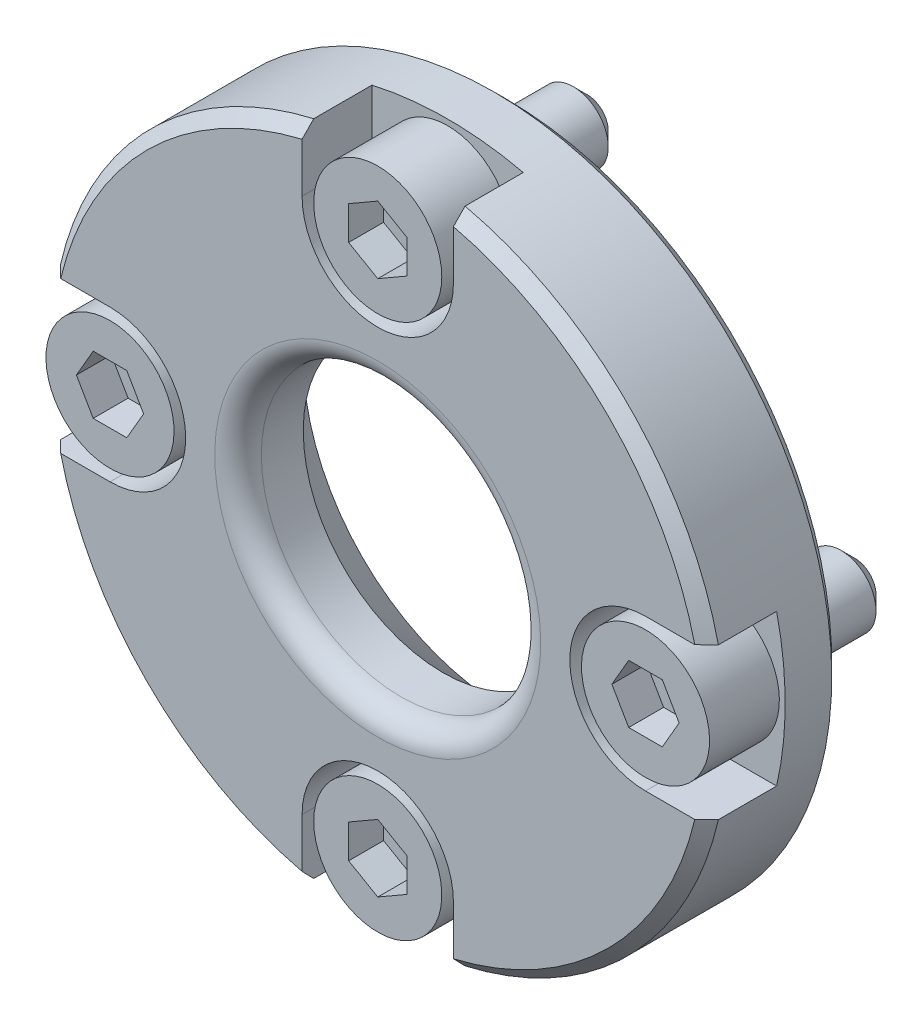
ISO-10303-21;
HEADER;
FILE_DESCRIPTION(('STEP AP214'),'2;1');
FILE_NAME('part.step','',(''),(''),'','','');
FILE_SCHEMA(('AUTOMOTIVE_DESIGN { 1 0 10303 214 1 1 1 1 }'));
ENDSEC;
DATA;
#1=APPLICATION_CONTEXT('core data for automotive mechanical design processes');
#2=APPLICATION_PROTOCOL_DEFINITION('international standard','automotive_design',2000,#1);
#3=PRODUCT_CONTEXT('',#1,'mechanical');
#4=PRODUCT('Part','Part','',(#3));
#5=PRODUCT_RELATED_PRODUCT_CATEGORY('part','',(#4));
#6=PRODUCT_DEFINITION_FORMATION('','',#4);
#7=PRODUCT_DEFINITION_CONTEXT('part definition',#1,'design');
#8=PRODUCT_DEFINITION('design','',#6,#7);
#9=PRODUCT_DEFINITION_SHAPE('','',#8);
#10=(LENGTH_UNIT() NAMED_UNIT(*) SI_UNIT(.MILLI.,.METRE.));
#11=(NAMED_UNIT(*) PLANE_ANGLE_UNIT() SI_UNIT($,.RADIAN.));
#12=(NAMED_UNIT(*) SI_UNIT($,.STERADIAN.) SOLID_ANGLE_UNIT());
#13=UNCERTAINTY_MEASURE_WITH_UNIT(LENGTH_MEASURE(1.E-05),#10,'distance_accuracy_value','');
#14=(GEOMETRIC_REPRESENTATION_CONTEXT(3) GLOBAL_UNCERTAINTY_ASSIGNED_CONTEXT((#13)) GLOBAL_UNIT_ASSIGNED_CONTEXT((#10,
#11,#12)) REPRESENTATION_CONTEXT('',''));
#15=CARTESIAN_POINT('',(0.,0.,0.));
#16=DIRECTION('',(0.,0.,1.));
#17=DIRECTION('',(1.,0.,0.));
#18=AXIS2_PLACEMENT_3D('',#15,#16,#17);
#19=CARTESIAN_POINT('',(-11.5,1.49999999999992,-9.));
#20=DIRECTION('',(0.,0.,-1.));
#21=DIRECTION('',(0.,-1.,0.));
#22=AXIS2_PLACEMENT_3D('',#19,#20,#21);
#23=PLANE('',#22);
#24=CARTESIAN_POINT('',(-11.5,0.,-9.));
#25=DIRECTION('',(0.,0.,-1.));
#26=DIRECTION('',(0.,-1.,0.));
#27=AXIS2_PLACEMENT_3D('',#24,#25,#26);
#28=CIRCLE('',#27,0.9);
#29=CARTESIAN_POINT('',(-11.5,-0.900000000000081,-9.));
#30=VERTEX_POINT('',#29);
#31=EDGE_CURVE('E24',#30,#30,#28,.T.);
#32=ORIENTED_EDGE('',*,*,#31,.T.);
#33=EDGE_LOOP('',(#32));
#34=FACE_BOUND('',#33,.T.);
#35=ADVANCED_FACE('F14',(#34),#23,.T.);
#36=CARTESIAN_POINT('',(-11.5,0.,-8.4));
#37=DIRECTION('',(0.,0.,1.));
#38=DIRECTION('',(0.,1.,0.));
#39=AXIS2_PLACEMENT_3D('',#36,#37,#38);
#40=CONICAL_SURFACE('',#39,1.5,0.785398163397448);
#41=ORIENTED_EDGE('',*,*,#31,.F.);
#42=EDGE_LOOP('',(#41));
#43=FACE_BOUND('',#42,.T.);
#44=CARTESIAN_POINT('',(-11.5,0.,-8.4));
#45=DIRECTION('',(0.,0.,-1.));
#46=DIRECTION('',(0.,-1.,0.));
#47=AXIS2_PLACEMENT_3D('',#44,#45,#46);
#48=CIRCLE('',#47,1.5);
#49=CARTESIAN_POINT('',(-11.5,-1.50000000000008,-8.4));
#50=VERTEX_POINT('',#49);
#51=EDGE_CURVE('E657',#50,#50,#48,.F.);
#52=ORIENTED_EDGE('',*,*,#51,.F.);
#53=EDGE_LOOP('',(#52));
#54=FACE_BOUND('',#53,.T.);
#55=ADVANCED_FACE('F552',(#43,#54),#40,.T.);
#56=CARTESIAN_POINT('',(-11.5,0.,11.));
#57=DIRECTION('',(0.,0.,1.));
#58=DIRECTION('',(0.,1.,0.));
#59=AXIS2_PLACEMENT_3D('',#56,#57,#58);
#60=CYLINDRICAL_SURFACE('',#59,1.5);
#61=ORIENTED_EDGE('',*,*,#51,.T.);
#62=EDGE_LOOP('',(#61));
#63=FACE_BOUND('',#62,.T.);
#64=CARTESIAN_POINT('',(-11.5,0.,-3.));
#65=DIRECTION('',(0.,0.,1.));
#66=DIRECTION('',(0.,1.,0.));
#67=AXIS2_PLACEMENT_3D('',#64,#65,#66);
#68=CIRCLE('',#67,1.5);
#69=CARTESIAN_POINT('',(-11.5,1.49999999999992,-3.));
#70=VERTEX_POINT('',#69);
#71=EDGE_CURVE('E648',#70,#70,#68,.T.);
#72=ORIENTED_EDGE('',*,*,#71,.F.);
#73=EDGE_LOOP('',(#72));
#74=FACE_BOUND('',#73,.T.);
#75=ADVANCED_FACE('F555',(#63,#74),#60,.T.);
#76=CARTESIAN_POINT('',(-11.5,2.74999999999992,-3.));
#77=DIRECTION('',(0.,0.,-1.));
#78=DIRECTION('',(0.,-1.,0.));
#79=AXIS2_PLACEMENT_3D('',#76,#77,#78);
#80=PLANE('',#79);
#81=ORIENTED_EDGE('',*,*,#71,.T.);
#82=EDGE_LOOP('',(#81));
#83=FACE_BOUND('',#82,.T.);
#84=CARTESIAN_POINT('',(-11.5,0.,-3.));
#85=DIRECTION('',(0.,0.,-1.));
#86=DIRECTION('',(-1.,0.,0.));
#87=AXIS2_PLACEMENT_3D('',#84,#85,#86);
#88=CIRCLE('',#87,1.7);
#89=CARTESIAN_POINT('',(-13.2,0.,-3.));
#90=VERTEX_POINT('',#89);
#91=EDGE_CURVE('E9',#90,#90,#88,.T.);
#92=ORIENTED_EDGE('',*,*,#91,.T.);
#93=EDGE_LOOP('',(#92));
#94=FACE_BOUND('',#93,.T.);
#95=ADVANCED_FACE('F526',(#83,#94),#80,.T.);
#96=CARTESIAN_POINT('',(-12.9433756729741,0.,-1.5));
#97=DIRECTION('',(0.866025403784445,-0.499999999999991,0.));
#98=DIRECTION('',(0.499999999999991,0.866025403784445,0.));
#99=AXIS2_PLACEMENT_3D('',#96,#97,#98);
#100=PLANE('',#99);
#101=DIRECTION('',(0.,0.,1.));
#102=VECTOR('',#101,1.);
#103=CARTESIAN_POINT('',(-12.221687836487,1.24999999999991,-1.5));
#104=LINE('',#103,#102);
#105=CARTESIAN_POINT('',(-12.221687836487,1.24999999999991,-1.5));
#106=VERTEX_POINT('',#105);
#107=CARTESIAN_POINT('',(-12.221687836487,1.24999999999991,0.));
#108=VERTEX_POINT('',#107);
#109=EDGE_CURVE('E646',#106,#108,#104,.T.);
#110=ORIENTED_EDGE('',*,*,#109,.T.);
#111=DIRECTION('',(0.499999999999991,0.866025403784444,0.));
#112=VECTOR('',#111,1.);
#113=CARTESIAN_POINT('',(-12.9433756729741,0.,0.));
#114=LINE('',#113,#112);
#115=CARTESIAN_POINT('',(-12.9433756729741,0.,0.));
#116=VERTEX_POINT('',#115);
#117=EDGE_CURVE('E33',#116,#108,#114,.T.);
#118=ORIENTED_EDGE('',*,*,#117,.F.);
#119=DIRECTION('',(0.,0.,1.));
#120=VECTOR('',#119,1.);
#121=CARTESIAN_POINT('',(-12.9433756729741,0.,-1.5));
#122=LINE('',#121,#120);
#123=CARTESIAN_POINT('',(-12.9433756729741,0.,-1.5));
#124=VERTEX_POINT('',#123);
#125=EDGE_CURVE('E618',#124,#116,#122,.T.);
#126=ORIENTED_EDGE('',*,*,#125,.F.);
#127=DIRECTION('',(0.499999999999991,0.866025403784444,0.));
#128=VECTOR('',#127,1.);
#129=CARTESIAN_POINT('',(-12.9433756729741,0.,-1.5));
#130=LINE('',#129,#128);
#131=EDGE_CURVE('E606',#124,#106,#130,.T.);
#132=ORIENTED_EDGE('',*,*,#131,.T.);
#133=EDGE_LOOP('',(#110,#118,#126,#132));
#134=FACE_BOUND('',#133,.T.);
#135=ADVANCED_FACE('F514',(#134),#100,.T.);
#136=CARTESIAN_POINT('',(-10.778312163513,1.24999999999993,-1.5));
#137=DIRECTION('',(0.,1.,0.));
#138=DIRECTION('',(-1.,0.,0.));
#139=AXIS2_PLACEMENT_3D('',#136,#137,#138);
#140=PLANE('',#139);
#141=DIRECTION('',(0.,0.,1.));
#142=VECTOR('',#141,1.);
#143=CARTESIAN_POINT('',(-10.778312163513,1.24999999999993,-1.5));
#144=LINE('',#143,#142);
#145=CARTESIAN_POINT('',(-10.778312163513,1.24999999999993,-1.5));
#146=VERTEX_POINT('',#145);
#147=CARTESIAN_POINT('',(-10.778312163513,1.24999999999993,0.));
#148=VERTEX_POINT('',#147);
#149=EDGE_CURVE('E643',#146,#148,#144,.T.);
#150=ORIENTED_EDGE('',*,*,#149,.T.);
#151=DIRECTION('',(-1.,0.,0.));
#152=VECTOR('',#151,1.);
#153=CARTESIAN_POINT('',(-10.778312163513,1.24999999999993,0.));
#154=LINE('',#153,#152);
#155=EDGE_CURVE('E1678',#148,#108,#154,.T.);
#156=ORIENTED_EDGE('',*,*,#155,.T.);
#157=ORIENTED_EDGE('',*,*,#109,.F.);
#158=DIRECTION('',(-1.,0.,0.));
#159=VECTOR('',#158,1.);
#160=CARTESIAN_POINT('',(-10.778312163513,1.24999999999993,-1.5));
#161=LINE('',#160,#159);
#162=EDGE_CURVE('E613',#146,#106,#161,.T.);
#163=ORIENTED_EDGE('',*,*,#162,.F.);
#164=EDGE_LOOP('',(#150,#156,#157,#163));
#165=FACE_BOUND('',#164,.T.);
#166=ADVANCED_FACE('F575',(#165),#140,.F.);
#167=CARTESIAN_POINT('',(-10.0566243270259,0.,-1.5));
#168=DIRECTION('',(0.866025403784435,0.500000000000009,0.));
#169=DIRECTION('',(-0.500000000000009,0.866025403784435,0.));
#170=AXIS2_PLACEMENT_3D('',#167,#168,#169);
#171=PLANE('',#170);
#172=DIRECTION('',(0.,0.,1.));
#173=VECTOR('',#172,1.);
#174=CARTESIAN_POINT('',(-10.0566243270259,0.,-1.5));
#175=LINE('',#174,#173);
#176=CARTESIAN_POINT('',(-10.0566243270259,0.,-1.5));
#177=VERTEX_POINT('',#176);
#178=CARTESIAN_POINT('',(-10.0566243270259,0.,0.));
#179=VERTEX_POINT('',#178);
#180=EDGE_CURVE('E640',#177,#179,#175,.T.);
#181=ORIENTED_EDGE('',*,*,#180,.T.);
#182=DIRECTION('',(-0.500000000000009,0.866025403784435,0.));
#183=VECTOR('',#182,1.);
#184=CARTESIAN_POINT('',(-10.0566243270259,0.,0.));
#185=LINE('',#184,#183);
#186=EDGE_CURVE('E1676',#179,#148,#185,.T.);
#187=ORIENTED_EDGE('',*,*,#186,.T.);
#188=ORIENTED_EDGE('',*,*,#149,.F.);
#189=DIRECTION('',(-0.500000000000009,0.866025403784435,0.));
#190=VECTOR('',#189,1.);
#191=CARTESIAN_POINT('',(-10.0566243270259,0.,-1.5));
#192=LINE('',#191,#190);
#193=EDGE_CURVE('E633',#177,#146,#192,.T.);
#194=ORIENTED_EDGE('',*,*,#193,.F.);
#195=EDGE_LOOP('',(#181,#187,#188,#194));
#196=FACE_BOUND('',#195,.T.);
#197=ADVANCED_FACE('F578',(#196),#171,.F.);
#198=CARTESIAN_POINT('',(-10.0566243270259,0.,-1.5));
#199=DIRECTION('',(-0.866025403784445,0.499999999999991,0.));
#200=DIRECTION('',(-0.499999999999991,-0.866025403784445,0.));
#201=AXIS2_PLACEMENT_3D('',#198,#199,#200);
#202=PLANE('',#201);
#203=DIRECTION('',(0.,0.,1.));
#204=VECTOR('',#203,1.);
#205=CARTESIAN_POINT('',(-10.7783121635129,-1.25000000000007,-1.5));
#206=LINE('',#205,#204);
#207=CARTESIAN_POINT('',(-10.7783121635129,-1.25000000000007,-1.5));
#208=VERTEX_POINT('',#207);
#209=CARTESIAN_POINT('',(-10.7783121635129,-1.25000000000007,0.));
#210=VERTEX_POINT('',#209);
#211=EDGE_CURVE('E637',#208,#210,#206,.T.);
#212=ORIENTED_EDGE('',*,*,#211,.T.);
#213=DIRECTION('',(-0.499999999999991,-0.866025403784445,0.));
#214=VECTOR('',#213,1.);
#215=CARTESIAN_POINT('',(-10.0566243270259,0.,0.));
#216=LINE('',#215,#214);
#217=EDGE_CURVE('E1672',#179,#210,#216,.T.);
#218=ORIENTED_EDGE('',*,*,#217,.F.);
#219=ORIENTED_EDGE('',*,*,#180,.F.);
#220=DIRECTION('',(-0.499999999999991,-0.866025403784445,0.));
#221=VECTOR('',#220,1.);
#222=CARTESIAN_POINT('',(-10.0566243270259,0.,-1.5));
#223=LINE('',#222,#221);
#224=EDGE_CURVE('E626',#177,#208,#223,.T.);
#225=ORIENTED_EDGE('',*,*,#224,.T.);
#226=EDGE_LOOP('',(#212,#218,#219,#225));
#227=FACE_BOUND('',#226,.T.);
#228=ADVANCED_FACE('F582',(#227),#202,.T.);
#229=CARTESIAN_POINT('',(-12.221687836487,-1.25000000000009,-1.5));
#230=DIRECTION('',(0.,-1.,0.));
#231=DIRECTION('',(1.,0.,0.));
#232=AXIS2_PLACEMENT_3D('',#229,#230,#231);
#233=PLANE('',#232);
#234=DIRECTION('',(0.,0.,1.));
#235=VECTOR('',#234,1.);
#236=CARTESIAN_POINT('',(-12.221687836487,-1.25000000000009,-1.5));
#237=LINE('',#236,#235);
#238=CARTESIAN_POINT('',(-12.221687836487,-1.25000000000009,-1.5));
#239=VERTEX_POINT('',#238);
#240=CARTESIAN_POINT('',(-12.221687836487,-1.25000000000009,0.));
#241=VERTEX_POINT('',#240);
#242=EDGE_CURVE('E621',#239,#241,#237,.T.);
#243=ORIENTED_EDGE('',*,*,#242,.T.);
#244=DIRECTION('',(1.,0.,0.));
#245=VECTOR('',#244,1.);
#246=CARTESIAN_POINT('',(-12.221687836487,-1.25000000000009,0.));
#247=LINE('',#246,#245);
#248=EDGE_CURVE('E1670',#241,#210,#247,.T.);
#249=ORIENTED_EDGE('',*,*,#248,.T.);
#250=ORIENTED_EDGE('',*,*,#211,.F.);
#251=DIRECTION('',(1.,0.,0.));
#252=VECTOR('',#251,1.);
#253=CARTESIAN_POINT('',(-12.221687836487,-1.25000000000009,-1.5));
#254=LINE('',#253,#252);
#255=EDGE_CURVE('E623',#239,#208,#254,.T.);
#256=ORIENTED_EDGE('',*,*,#255,.F.);
#257=EDGE_LOOP('',(#243,#249,#250,#256));
#258=FACE_BOUND('',#257,.T.);
#259=ADVANCED_FACE('F586',(#258),#233,.F.);
#260=CARTESIAN_POINT('',(-12.9433756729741,0.,-1.5));
#261=DIRECTION('',(-0.866025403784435,-0.500000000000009,0.));
#262=DIRECTION('',(0.500000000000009,-0.866025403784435,0.));
#263=AXIS2_PLACEMENT_3D('',#260,#261,#262);
#264=PLANE('',#263);
#265=DIRECTION('',(0.500000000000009,-0.866025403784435,0.));
#266=VECTOR('',#265,1.);
#267=CARTESIAN_POINT('',(-12.9433756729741,0.,-1.5));
#268=LINE('',#267,#266);
#269=EDGE_CURVE('E609',#124,#239,#268,.T.);
#270=ORIENTED_EDGE('',*,*,#269,.F.);
#271=ORIENTED_EDGE('',*,*,#125,.T.);
#272=DIRECTION('',(0.500000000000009,-0.866025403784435,0.));
#273=VECTOR('',#272,1.);
#274=CARTESIAN_POINT('',(-12.9433756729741,0.,0.));
#275=LINE('',#274,#273);
#276=EDGE_CURVE('E614',#116,#241,#275,.T.);
#277=ORIENTED_EDGE('',*,*,#276,.T.);
#278=ORIENTED_EDGE('',*,*,#242,.F.);
#279=EDGE_LOOP('',(#270,#271,#277,#278));
#280=FACE_BOUND('',#279,.T.);
#281=ADVANCED_FACE('F562',(#280),#264,.F.);
#282=CARTESIAN_POINT('',(-12.221687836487,1.24999999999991,-1.5));
#283=DIRECTION('',(0.,0.,1.));
#284=DIRECTION('',(0.,1.,0.));
#285=AXIS2_PLACEMENT_3D('',#282,#283,#284);
#286=PLANE('',#285);
#287=ORIENTED_EDGE('',*,*,#131,.F.);
#288=ORIENTED_EDGE('',*,*,#269,.T.);
#289=ORIENTED_EDGE('',*,*,#255,.T.);
#290=ORIENTED_EDGE('',*,*,#224,.F.);
#291=ORIENTED_EDGE('',*,*,#193,.T.);
#292=ORIENTED_EDGE('',*,*,#162,.T.);
#293=EDGE_LOOP('',(#287,#288,#289,#290,#291,#292));
#294=FACE_BOUND('',#293,.T.);
#295=ADVANCED_FACE('F560',(#294),#286,.T.);
#296=CARTESIAN_POINT('',(-11.5,0.,0.));
#297=DIRECTION('',(0.,0.,1.));
#298=DIRECTION('',(0.,1.,0.));
#299=AXIS2_PLACEMENT_3D('',#296,#297,#298);
#300=PLANE('',#299);
#301=CARTESIAN_POINT('',(-11.5,0.,0.));
#302=DIRECTION('',(0.,0.,1.));
#303=DIRECTION('',(0.,1.,0.));
#304=AXIS2_PLACEMENT_3D('',#301,#302,#303);
#305=CIRCLE('',#304,2.75);
#306=CARTESIAN_POINT('',(-11.5,2.74999999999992,0.));
#307=VERTEX_POINT('',#306);
#308=EDGE_CURVE('E654',#307,#307,#305,.T.);
#309=ORIENTED_EDGE('',*,*,#308,.T.);
#310=EDGE_LOOP('',(#309));
#311=FACE_BOUND('',#310,.T.);
#312=ORIENTED_EDGE('',*,*,#276,.F.);
#313=ORIENTED_EDGE('',*,*,#117,.T.);
#314=ORIENTED_EDGE('',*,*,#155,.F.);
#315=ORIENTED_EDGE('',*,*,#186,.F.);
#316=ORIENTED_EDGE('',*,*,#217,.T.);
#317=ORIENTED_EDGE('',*,*,#248,.F.);
#318=EDGE_LOOP('',(#312,#313,#314,#315,#316,#317));
#319=FACE_BOUND('',#318,.T.);
#320=ADVANCED_FACE('F557',(#311,#319),#300,.T.);
#321=CARTESIAN_POINT('',(-11.5,0.,11.));
#322=DIRECTION('',(0.,0.,1.));
#323=DIRECTION('',(0.,1.,0.));
#324=AXIS2_PLACEMENT_3D('',#321,#322,#323);
#325=CYLINDRICAL_SURFACE('',#324,2.75);
#326=CARTESIAN_POINT('',(-11.5,0.,-3.));
#327=DIRECTION('',(0.,0.,1.));
#328=DIRECTION('',(0.,1.,0.));
#329=AXIS2_PLACEMENT_3D('',#326,#327,#328);
#330=CIRCLE('',#329,2.75);
#331=CARTESIAN_POINT('',(-11.5,2.74999999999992,-3.));
#332=VERTEX_POINT('',#331);
#333=EDGE_CURVE('E651',#332,#332,#330,.T.);
#334=ORIENTED_EDGE('',*,*,#333,.T.);
#335=EDGE_LOOP('',(#334));
#336=FACE_BOUND('',#335,.T.);
#337=ORIENTED_EDGE('',*,*,#308,.F.);
#338=EDGE_LOOP('',(#337));
#339=FACE_BOUND('',#338,.T.);
#340=ADVANCED_FACE('F550',(#336,#339),#325,.T.);
#341=CARTESIAN_POINT('',(1.24999999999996,12.221687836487,-1.5));
#342=DIRECTION('',(0.,0.,1.));
#343=DIRECTION('',(1.,0.,0.));
#344=AXIS2_PLACEMENT_3D('',#341,#342,#343);
#345=PLANE('',#344);
#346=DIRECTION('',(0.866025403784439,-0.5,0.));
#347=VECTOR('',#346,1.);
#348=CARTESIAN_POINT('',(0.,12.9433756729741,-1.5));
#349=LINE('',#348,#347);
#350=CARTESIAN_POINT('',(0.,12.9433756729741,-1.5));
#351=VERTEX_POINT('',#350);
#352=CARTESIAN_POINT('',(1.24999999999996,12.221687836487,-1.5));
#353=VERTEX_POINT('',#352);
#354=EDGE_CURVE('E665',#351,#353,#349,.T.);
#355=ORIENTED_EDGE('',*,*,#354,.F.);
#356=DIRECTION('',(-0.86602540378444,-0.5,0.));
#357=VECTOR('',#356,1.);
#358=CARTESIAN_POINT('',(0.,12.9433756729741,-1.5));
#359=LINE('',#358,#357);
#360=CARTESIAN_POINT('',(-1.25000000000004,12.221687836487,-1.5));
#361=VERTEX_POINT('',#360);
#362=EDGE_CURVE('E682',#351,#361,#359,.T.);
#363=ORIENTED_EDGE('',*,*,#362,.T.);
#364=DIRECTION('',(0.,-1.,0.));
#365=VECTOR('',#364,1.);
#366=CARTESIAN_POINT('',(-1.25000000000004,12.221687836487,-1.5));
#367=LINE('',#366,#365);
#368=CARTESIAN_POINT('',(-1.25000000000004,10.778312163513,-1.5));
#369=VERTEX_POINT('',#368);
#370=EDGE_CURVE('E686',#361,#369,#367,.T.);
#371=ORIENTED_EDGE('',*,*,#370,.T.);
#372=DIRECTION('',(-0.86602540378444,0.5,0.));
#373=VECTOR('',#372,1.);
#374=CARTESIAN_POINT('',(0.,10.0566243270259,-1.5));
#375=LINE('',#374,#373);
#376=CARTESIAN_POINT('',(0.,10.0566243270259,-1.5));
#377=VERTEX_POINT('',#376);
#378=EDGE_CURVE('E689',#377,#369,#375,.T.);
#379=ORIENTED_EDGE('',*,*,#378,.F.);
#380=DIRECTION('',(0.86602540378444,0.5,0.));
#381=VECTOR('',#380,1.);
#382=CARTESIAN_POINT('',(0.,10.0566243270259,-1.5));
#383=LINE('',#382,#381);
#384=CARTESIAN_POINT('',(1.24999999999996,10.778312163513,-1.5));
#385=VERTEX_POINT('',#384);
#386=EDGE_CURVE('E692',#377,#385,#383,.T.);
#387=ORIENTED_EDGE('',*,*,#386,.T.);
#388=DIRECTION('',(0.,1.,0.));
#389=VECTOR('',#388,1.);
#390=CARTESIAN_POINT('',(1.24999999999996,10.778312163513,-1.5));
#391=LINE('',#390,#389);
#392=EDGE_CURVE('E695',#385,#353,#391,.T.);
#393=ORIENTED_EDGE('',*,*,#392,.T.);
#394=EDGE_LOOP('',(#355,#363,#371,#379,#387,#393));
#395=FACE_BOUND('',#394,.T.);
#396=ADVANCED_FACE('F453',(#395),#345,.T.);
#397=CARTESIAN_POINT('',(-1.25000000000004,-12.221687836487,-1.5));
#398=DIRECTION('',(0.,0.,1.));
#399=DIRECTION('',(-1.,0.,0.));
#400=AXIS2_PLACEMENT_3D('',#397,#398,#399);
#401=PLANE('',#400);
#402=DIRECTION('',(-0.866025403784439,0.5,0.));
#403=VECTOR('',#402,1.);
#404=CARTESIAN_POINT('',(0.,-12.9433756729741,-1.5));
#405=LINE('',#404,#403);
#406=CARTESIAN_POINT('',(0.,-12.9433756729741,-1.5));
#407=VERTEX_POINT('',#406);
#408=CARTESIAN_POINT('',(-1.25000000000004,-12.221687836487,-1.5));
#409=VERTEX_POINT('',#408);
#410=EDGE_CURVE('E800',#407,#409,#405,.T.);
#411=ORIENTED_EDGE('',*,*,#410,.F.);
#412=DIRECTION('',(0.86602540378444,0.5,0.));
#413=VECTOR('',#412,1.);
#414=CARTESIAN_POINT('',(0.,-12.9433756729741,-1.5));
#415=LINE('',#414,#413);
#416=CARTESIAN_POINT('',(1.24999999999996,-12.221687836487,-1.5));
#417=VERTEX_POINT('',#416);
#418=EDGE_CURVE('E816',#407,#417,#415,.T.);
#419=ORIENTED_EDGE('',*,*,#418,.T.);
#420=DIRECTION('',(0.,1.,0.));
#421=VECTOR('',#420,1.);
#422=CARTESIAN_POINT('',(1.24999999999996,-12.221687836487,-1.5));
#423=LINE('',#422,#421);
#424=CARTESIAN_POINT('',(1.24999999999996,-10.778312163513,-1.5));
#425=VERTEX_POINT('',#424);
#426=EDGE_CURVE('E820',#417,#425,#423,.T.);
#427=ORIENTED_EDGE('',*,*,#426,.T.);
#428=DIRECTION('',(0.86602540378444,-0.5,0.));
#429=VECTOR('',#428,1.);
#430=CARTESIAN_POINT('',(0.,-10.0566243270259,-1.5));
#431=LINE('',#430,#429);
#432=CARTESIAN_POINT('',(0.,-10.0566243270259,-1.5));
#433=VERTEX_POINT('',#432);
#434=EDGE_CURVE('E823',#433,#425,#431,.T.);
#435=ORIENTED_EDGE('',*,*,#434,.F.);
#436=DIRECTION('',(-0.86602540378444,-0.5,0.));
#437=VECTOR('',#436,1.);
#438=CARTESIAN_POINT('',(0.,-10.0566243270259,-1.5));
#439=LINE('',#438,#437);
#440=CARTESIAN_POINT('',(-1.25000000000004,-10.778312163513,-1.5));
#441=VERTEX_POINT('',#440);
#442=EDGE_CURVE('E826',#433,#441,#439,.T.);
#443=ORIENTED_EDGE('',*,*,#442,.T.);
#444=DIRECTION('',(0.,-1.,0.));
#445=VECTOR('',#444,1.);
#446=CARTESIAN_POINT('',(-1.25000000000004,-10.778312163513,-1.5));
#447=LINE('',#446,#445);
#448=EDGE_CURVE('E829',#441,#409,#447,.T.);
#449=ORIENTED_EDGE('',*,*,#448,.T.);
#450=EDGE_LOOP('',(#411,#419,#427,#435,#443,#449));
#451=FACE_BOUND('',#450,.T.);
#452=ADVANCED_FACE('F443',(#451),#401,.T.);
#453=CARTESIAN_POINT('',(12.221687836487,-1.25,-1.5));
#454=DIRECTION('',(0.,0.,1.));
#455=DIRECTION('',(0.,-1.,0.));
#456=AXIS2_PLACEMENT_3D('',#453,#454,#455);
#457=PLANE('',#456);
#458=DIRECTION('',(-0.5,-0.866025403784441,0.));
#459=VECTOR('',#458,1.);
#460=CARTESIAN_POINT('',(12.9433756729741,0.,-1.5));
#461=LINE('',#460,#459);
#462=CARTESIAN_POINT('',(12.9433756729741,0.,-1.5));
#463=VERTEX_POINT('',#462);
#464=CARTESIAN_POINT('',(12.221687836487,-1.25,-1.5));
#465=VERTEX_POINT('',#464);
#466=EDGE_CURVE('E733',#463,#465,#461,.T.);
#467=ORIENTED_EDGE('',*,*,#466,.F.);
#468=DIRECTION('',(-0.5,0.866025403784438,0.));
#469=VECTOR('',#468,1.);
#470=CARTESIAN_POINT('',(12.9433756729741,0.,-1.5));
#471=LINE('',#470,#469);
#472=CARTESIAN_POINT('',(12.221687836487,1.25,-1.5));
#473=VERTEX_POINT('',#472);
#474=EDGE_CURVE('E750',#463,#473,#471,.T.);
#475=ORIENTED_EDGE('',*,*,#474,.T.);
#476=DIRECTION('',(-1.,0.,0.));
#477=VECTOR('',#476,1.);
#478=CARTESIAN_POINT('',(12.221687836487,1.25,-1.5));
#479=LINE('',#478,#477);
#480=CARTESIAN_POINT('',(10.778312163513,1.25,-1.5));
#481=VERTEX_POINT('',#480);
#482=EDGE_CURVE('E754',#473,#481,#479,.T.);
#483=ORIENTED_EDGE('',*,*,#482,.T.);
#484=DIRECTION('',(0.5,0.866025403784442,0.));
#485=VECTOR('',#484,1.);
#486=CARTESIAN_POINT('',(10.0566243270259,0.,-1.5));
#487=LINE('',#486,#485);
#488=CARTESIAN_POINT('',(10.0566243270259,0.,-1.5));
#489=VERTEX_POINT('',#488);
#490=EDGE_CURVE('E757',#489,#481,#487,.T.);
#491=ORIENTED_EDGE('',*,*,#490,.F.);
#492=DIRECTION('',(0.5,-0.866025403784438,0.));
#493=VECTOR('',#492,1.);
#494=CARTESIAN_POINT('',(10.0566243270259,0.,-1.5));
#495=LINE('',#494,#493);
#496=CARTESIAN_POINT('',(10.778312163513,-1.25,-1.5));
#497=VERTEX_POINT('',#496);
#498=EDGE_CURVE('E760',#489,#497,#495,.T.);
#499=ORIENTED_EDGE('',*,*,#498,.T.);
#500=DIRECTION('',(1.,0.,0.));
#501=VECTOR('',#500,1.);
#502=CARTESIAN_POINT('',(10.778312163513,-1.25,-1.5));
#503=LINE('',#502,#501);
#504=EDGE_CURVE('E763',#497,#465,#503,.T.);
#505=ORIENTED_EDGE('',*,*,#504,.T.);
#506=EDGE_LOOP('',(#467,#475,#483,#491,#499,#505));
#507=FACE_BOUND('',#506,.T.);
#508=ADVANCED_FACE('F423',(#507),#457,.T.);
#509=CARTESIAN_POINT('',(-1.50000000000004,-11.5,-9.));
#510=DIRECTION('',(0.,0.,-1.));
#511=DIRECTION('',(1.,0.,0.));
#512=AXIS2_PLACEMENT_3D('',#509,#510,#511);
#513=PLANE('',#512);
#514=CARTESIAN_POINT('',(0.,-11.5,-9.));
#515=DIRECTION('',(0.,0.,-1.));
#516=DIRECTION('',(1.,0.,0.));
#517=AXIS2_PLACEMENT_3D('',#514,#515,#516);
#518=CIRCLE('',#517,0.9);
#519=CARTESIAN_POINT('',(0.89999999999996,-11.5,-9.));
#520=VERTEX_POINT('',#519);
#521=EDGE_CURVE('E858',#520,#520,#518,.T.);
#522=ORIENTED_EDGE('',*,*,#521,.T.);
#523=EDGE_LOOP('',(#522));
#524=FACE_BOUND('',#523,.T.);
#525=ADVANCED_FACE('F394',(#524),#513,.T.);
#526=CARTESIAN_POINT('',(11.5,-1.5,-9.));
#527=DIRECTION('',(0.,0.,-1.));
#528=DIRECTION('',(0.,1.,0.));
#529=AXIS2_PLACEMENT_3D('',#526,#527,#528);
#530=PLANE('',#529);
#531=CARTESIAN_POINT('',(11.5,0.,-9.));
#532=DIRECTION('',(0.,0.,-1.));
#533=DIRECTION('',(0.,1.,0.));
#534=AXIS2_PLACEMENT_3D('',#531,#532,#533);
#535=CIRCLE('',#534,0.9);
#536=CARTESIAN_POINT('',(11.5,0.9,-9.));
#537=VERTEX_POINT('',#536);
#538=EDGE_CURVE('E792',#537,#537,#535,.T.);
#539=ORIENTED_EDGE('',*,*,#538,.T.);
#540=EDGE_LOOP('',(#539));
#541=FACE_BOUND('',#540,.T.);
#542=ADVANCED_FACE('F422',(#541),#530,.T.);
#543=CARTESIAN_POINT('',(1.49999999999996,11.5,-9.));
#544=DIRECTION('',(0.,0.,-1.));
#545=DIRECTION('',(-1.,0.,0.));
#546=AXIS2_PLACEMENT_3D('',#543,#544,#545);
#547=PLANE('',#546);
#548=CARTESIAN_POINT('',(0.,11.5,-9.));
#549=DIRECTION('',(0.,0.,-1.));
#550=DIRECTION('',(-1.,0.,0.));
#551=AXIS2_PLACEMENT_3D('',#548,#549,#550);
#552=CIRCLE('',#551,0.9);
#553=CARTESIAN_POINT('',(-0.90000000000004,11.5,-9.));
#554=VERTEX_POINT('',#553);
#555=EDGE_CURVE('E724',#554,#554,#552,.T.);
#556=ORIENTED_EDGE('',*,*,#555,.T.);
#557=EDGE_LOOP('',(#556));
#558=FACE_BOUND('',#557,.T.);
#559=ADVANCED_FACE('F478',(#558),#547,.T.);
#560=CARTESIAN_POINT('',(-1.25000000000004,12.221687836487,-1.5));
#561=DIRECTION('',(-1.,0.,0.));
#562=DIRECTION('',(0.,-1.,0.));
#563=AXIS2_PLACEMENT_3D('',#560,#561,#562);
#564=PLANE('',#563);
#565=DIRECTION('',(0.,0.,1.));
#566=VECTOR('',#565,1.);
#567=CARTESIAN_POINT('',(-1.25000000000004,12.221687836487,-1.5));
#568=LINE('',#567,#566);
#569=CARTESIAN_POINT('',(-1.25000000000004,12.221687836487,0.));
#570=VERTEX_POINT('',#569);
#571=EDGE_CURVE('E702',#361,#570,#568,.T.);
#572=ORIENTED_EDGE('',*,*,#571,.T.);
#573=DIRECTION('',(0.,-1.,0.));
#574=VECTOR('',#573,1.);
#575=CARTESIAN_POINT('',(-1.25000000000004,12.221687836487,0.));
#576=LINE('',#575,#574);
#577=CARTESIAN_POINT('',(-1.25000000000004,10.778312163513,0.));
#578=VERTEX_POINT('',#577);
#579=EDGE_CURVE('E666',#570,#578,#576,.T.);
#580=ORIENTED_EDGE('',*,*,#579,.T.);
#581=DIRECTION('',(0.,0.,1.));
#582=VECTOR('',#581,1.);
#583=CARTESIAN_POINT('',(-1.25000000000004,10.778312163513,-1.5));
#584=LINE('',#583,#582);
#585=EDGE_CURVE('E704',#369,#578,#584,.T.);
#586=ORIENTED_EDGE('',*,*,#585,.F.);
#587=ORIENTED_EDGE('',*,*,#370,.F.);
#588=EDGE_LOOP('',(#572,#580,#586,#587));
#589=FACE_BOUND('',#588,.T.);
#590=ADVANCED_FACE('F524',(#589),#564,.F.);
#591=CARTESIAN_POINT('',(0.,10.0566243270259,-1.5));
#592=DIRECTION('',(0.5,0.86602540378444,0.));
#593=DIRECTION('',(-0.86602540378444,0.5,0.));
#594=AXIS2_PLACEMENT_3D('',#591,#592,#593);
#595=PLANE('',#594);
#596=ORIENTED_EDGE('',*,*,#585,.T.);
#597=DIRECTION('',(-0.86602540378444,0.5,0.));
#598=VECTOR('',#597,1.);
#599=CARTESIAN_POINT('',(0.,10.0566243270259,0.));
#600=LINE('',#599,#598);
#601=CARTESIAN_POINT('',(0.,10.0566243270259,0.));
#602=VERTEX_POINT('',#601);
#603=EDGE_CURVE('E669',#602,#578,#600,.T.);
#604=ORIENTED_EDGE('',*,*,#603,.F.);
#605=DIRECTION('',(0.,0.,1.));
#606=VECTOR('',#605,1.);
#607=CARTESIAN_POINT('',(0.,10.0566243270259,-1.5));
#608=LINE('',#607,#606);
#609=EDGE_CURVE('E706',#377,#602,#608,.T.);
#610=ORIENTED_EDGE('',*,*,#609,.F.);
#611=ORIENTED_EDGE('',*,*,#378,.T.);
#612=EDGE_LOOP('',(#596,#604,#610,#611));
#613=FACE_BOUND('',#612,.T.);
#614=ADVANCED_FACE('F534',(#613),#595,.T.);
#615=CARTESIAN_POINT('',(0.,10.0566243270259,-1.5));
#616=DIRECTION('',(0.5,-0.86602540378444,0.));
#617=DIRECTION('',(0.86602540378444,0.5,0.));
#618=AXIS2_PLACEMENT_3D('',#615,#616,#617);
#619=PLANE('',#618);
#620=ORIENTED_EDGE('',*,*,#609,.T.);
#621=DIRECTION('',(0.86602540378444,0.5,0.));
#622=VECTOR('',#621,1.);
#623=CARTESIAN_POINT('',(0.,10.0566243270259,0.));
#624=LINE('',#623,#622);
#625=CARTESIAN_POINT('',(1.24999999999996,10.778312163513,0.));
#626=VERTEX_POINT('',#625);
#627=EDGE_CURVE('E672',#602,#626,#624,.T.);
#628=ORIENTED_EDGE('',*,*,#627,.T.);
#629=DIRECTION('',(0.,0.,1.));
#630=VECTOR('',#629,1.);
#631=CARTESIAN_POINT('',(1.24999999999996,10.778312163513,-1.5));
#632=LINE('',#631,#630);
#633=EDGE_CURVE('E708',#385,#626,#632,.T.);
#634=ORIENTED_EDGE('',*,*,#633,.F.);
#635=ORIENTED_EDGE('',*,*,#386,.F.);
#636=EDGE_LOOP('',(#620,#628,#634,#635));
#637=FACE_BOUND('',#636,.T.);
#638=ADVANCED_FACE('F530',(#637),#619,.F.);
#639=CARTESIAN_POINT('',(1.24999999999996,10.778312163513,-1.5));
#640=DIRECTION('',(1.,0.,0.));
#641=DIRECTION('',(0.,1.,0.));
#642=AXIS2_PLACEMENT_3D('',#639,#640,#641);
#643=PLANE('',#642);
#644=ORIENTED_EDGE('',*,*,#633,.T.);
#645=DIRECTION('',(0.,1.,0.));
#646=VECTOR('',#645,1.);
#647=CARTESIAN_POINT('',(1.24999999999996,10.778312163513,0.));
#648=LINE('',#647,#646);
#649=CARTESIAN_POINT('',(1.24999999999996,12.221687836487,0.));
#650=VERTEX_POINT('',#649);
#651=EDGE_CURVE('E675',#626,#650,#648,.T.);
#652=ORIENTED_EDGE('',*,*,#651,.T.);
#653=DIRECTION('',(0.,0.,1.));
#654=VECTOR('',#653,1.);
#655=CARTESIAN_POINT('',(1.24999999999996,12.221687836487,-1.5));
#656=LINE('',#655,#654);
#657=EDGE_CURVE('E710',#353,#650,#656,.T.);
#658=ORIENTED_EDGE('',*,*,#657,.F.);
#659=ORIENTED_EDGE('',*,*,#392,.F.);
#660=EDGE_LOOP('',(#644,#652,#658,#659));
#661=FACE_BOUND('',#660,.T.);
#662=ADVANCED_FACE('F527',(#661),#643,.F.);
#663=CARTESIAN_POINT('',(0.,12.9433756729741,-1.5));
#664=DIRECTION('',(-0.5,-0.86602540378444,0.));
#665=DIRECTION('',(0.86602540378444,-0.5,0.));
#666=AXIS2_PLACEMENT_3D('',#663,#664,#665);
#667=PLANE('',#666);
#668=ORIENTED_EDGE('',*,*,#657,.T.);
#669=DIRECTION('',(0.866025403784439,-0.5,0.));
#670=VECTOR('',#669,1.);
#671=CARTESIAN_POINT('',(0.,12.9433756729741,0.));
#672=LINE('',#671,#670);
#673=CARTESIAN_POINT('',(0.,12.9433756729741,0.));
#674=VERTEX_POINT('',#673);
#675=EDGE_CURVE('E678',#674,#650,#672,.T.);
#676=ORIENTED_EDGE('',*,*,#675,.F.);
#677=DIRECTION('',(0.,0.,1.));
#678=VECTOR('',#677,1.);
#679=CARTESIAN_POINT('',(0.,12.9433756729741,-1.5));
#680=LINE('',#679,#678);
#681=EDGE_CURVE('E685',#351,#674,#680,.T.);
#682=ORIENTED_EDGE('',*,*,#681,.F.);
#683=ORIENTED_EDGE('',*,*,#354,.T.);
#684=EDGE_LOOP('',(#668,#676,#682,#683));
#685=FACE_BOUND('',#684,.T.);
#686=ADVANCED_FACE('F467',(#685),#667,.T.);
#687=CARTESIAN_POINT('',(0.,12.9433756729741,-1.5));
#688=DIRECTION('',(-0.5,0.86602540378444,0.));
#689=DIRECTION('',(-0.86602540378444,-0.5,0.));
#690=AXIS2_PLACEMENT_3D('',#687,#688,#689);
#691=PLANE('',#690);
#692=ORIENTED_EDGE('',*,*,#362,.F.);
#693=ORIENTED_EDGE('',*,*,#681,.T.);
#694=DIRECTION('',(-0.86602540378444,-0.5,0.));
#695=VECTOR('',#694,1.);
#696=CARTESIAN_POINT('',(0.,12.9433756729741,0.));
#697=LINE('',#696,#695);
#698=EDGE_CURVE('E662',#674,#570,#697,.T.);
#699=ORIENTED_EDGE('',*,*,#698,.T.);
#700=ORIENTED_EDGE('',*,*,#571,.F.);
#701=EDGE_LOOP('',(#692,#693,#699,#700));
#702=FACE_BOUND('',#701,.T.);
#703=ADVANCED_FACE('F441',(#702),#691,.F.);
#704=CARTESIAN_POINT('',(1.24999999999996,-12.221687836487,-1.5));
#705=DIRECTION('',(1.,0.,0.));
#706=DIRECTION('',(0.,1.,0.));
#707=AXIS2_PLACEMENT_3D('',#704,#705,#706);
#708=PLANE('',#707);
#709=DIRECTION('',(0.,0.,1.));
#710=VECTOR('',#709,1.);
#711=CARTESIAN_POINT('',(1.24999999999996,-12.221687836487,-1.5));
#712=LINE('',#711,#710);
#713=CARTESIAN_POINT('',(1.24999999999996,-12.221687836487,0.));
#714=VERTEX_POINT('',#713);
#715=EDGE_CURVE('E836',#417,#714,#712,.T.);
#716=ORIENTED_EDGE('',*,*,#715,.T.);
#717=DIRECTION('',(0.,1.,0.));
#718=VECTOR('',#717,1.);
#719=CARTESIAN_POINT('',(1.24999999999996,-12.221687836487,0.));
#720=LINE('',#719,#718);
#721=CARTESIAN_POINT('',(1.24999999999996,-10.778312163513,0.));
#722=VERTEX_POINT('',#721);
#723=EDGE_CURVE('E801',#714,#722,#720,.T.);
#724=ORIENTED_EDGE('',*,*,#723,.T.);
#725=DIRECTION('',(0.,0.,1.));
#726=VECTOR('',#725,1.);
#727=CARTESIAN_POINT('',(1.24999999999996,-10.778312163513,-1.5));
#728=LINE('',#727,#726);
#729=EDGE_CURVE('E838',#425,#722,#728,.T.);
#730=ORIENTED_EDGE('',*,*,#729,.F.);
#731=ORIENTED_EDGE('',*,*,#426,.F.);
#732=EDGE_LOOP('',(#716,#724,#730,#731));
#733=FACE_BOUND('',#732,.T.);
#734=ADVANCED_FACE('F437',(#733),#708,.F.);
#735=CARTESIAN_POINT('',(0.,-10.0566243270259,-1.5));
#736=DIRECTION('',(-0.5,-0.86602540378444,0.));
#737=DIRECTION('',(0.86602540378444,-0.5,0.));
#738=AXIS2_PLACEMENT_3D('',#735,#736,#737);
#739=PLANE('',#738);
#740=ORIENTED_EDGE('',*,*,#729,.T.);
#741=DIRECTION('',(0.86602540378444,-0.5,0.));
#742=VECTOR('',#741,1.);
#743=CARTESIAN_POINT('',(0.,-10.0566243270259,0.));
#744=LINE('',#743,#742);
#745=CARTESIAN_POINT('',(0.,-10.0566243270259,0.));
#746=VERTEX_POINT('',#745);
#747=EDGE_CURVE('E804',#746,#722,#744,.T.);
#748=ORIENTED_EDGE('',*,*,#747,.F.);
#749=DIRECTION('',(0.,0.,1.));
#750=VECTOR('',#749,1.);
#751=CARTESIAN_POINT('',(0.,-10.0566243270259,-1.5));
#752=LINE('',#751,#750);
#753=EDGE_CURVE('E840',#433,#746,#752,.T.);
#754=ORIENTED_EDGE('',*,*,#753,.F.);
#755=ORIENTED_EDGE('',*,*,#434,.T.);
#756=EDGE_LOOP('',(#740,#748,#754,#755));
#757=FACE_BOUND('',#756,.T.);
#758=ADVANCED_FACE('F433',(#757),#739,.T.);
#759=CARTESIAN_POINT('',(0.,-10.0566243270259,-1.5));
#760=DIRECTION('',(-0.5,0.86602540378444,0.));
#761=DIRECTION('',(-0.86602540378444,-0.5,0.));
#762=AXIS2_PLACEMENT_3D('',#759,#760,#761);
#763=PLANE('',#762);
#764=ORIENTED_EDGE('',*,*,#753,.T.);
#765=DIRECTION('',(-0.86602540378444,-0.5,0.));
#766=VECTOR('',#765,1.);
#767=CARTESIAN_POINT('',(0.,-10.0566243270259,0.));
#768=LINE('',#767,#766);
#769=CARTESIAN_POINT('',(-1.25000000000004,-10.778312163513,0.));
#770=VERTEX_POINT('',#769);
#771=EDGE_CURVE('E807',#746,#770,#768,.T.);
#772=ORIENTED_EDGE('',*,*,#771,.T.);
#773=DIRECTION('',(0.,0.,1.));
#774=VECTOR('',#773,1.);
#775=CARTESIAN_POINT('',(-1.25000000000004,-10.778312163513,-1.5));
#776=LINE('',#775,#774);
#777=EDGE_CURVE('E842',#441,#770,#776,.T.);
#778=ORIENTED_EDGE('',*,*,#777,.F.);
#779=ORIENTED_EDGE('',*,*,#442,.F.);
#780=EDGE_LOOP('',(#764,#772,#778,#779));
#781=FACE_BOUND('',#780,.T.);
#782=ADVANCED_FACE('F429',(#781),#763,.F.);
#783=CARTESIAN_POINT('',(-1.25000000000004,-10.778312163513,-1.5));
#784=DIRECTION('',(-1.,0.,0.));
#785=DIRECTION('',(0.,-1.,0.));
#786=AXIS2_PLACEMENT_3D('',#783,#784,#785);
#787=PLANE('',#786);
#788=ORIENTED_EDGE('',*,*,#777,.T.);
#789=DIRECTION('',(0.,-1.,0.));
#790=VECTOR('',#789,1.);
#791=CARTESIAN_POINT('',(-1.25000000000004,-10.778312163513,0.));
#792=LINE('',#791,#790);
#793=CARTESIAN_POINT('',(-1.25000000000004,-12.221687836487,0.));
#794=VERTEX_POINT('',#793);
#795=EDGE_CURVE('E810',#770,#794,#792,.T.);
#796=ORIENTED_EDGE('',*,*,#795,.T.);
#797=DIRECTION('',(0.,0.,1.));
#798=VECTOR('',#797,1.);
#799=CARTESIAN_POINT('',(-1.25000000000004,-12.221687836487,-1.5));
#800=LINE('',#799,#798);
#801=EDGE_CURVE('E844',#409,#794,#800,.T.);
#802=ORIENTED_EDGE('',*,*,#801,.F.);
#803=ORIENTED_EDGE('',*,*,#448,.F.);
#804=EDGE_LOOP('',(#788,#796,#802,#803));
#805=FACE_BOUND('',#804,.T.);
#806=ADVANCED_FACE('F425',(#805),#787,.F.);
#807=CARTESIAN_POINT('',(0.,-12.9433756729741,-1.5));
#808=DIRECTION('',(0.5,0.86602540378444,0.));
#809=DIRECTION('',(-0.86602540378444,0.5,0.));
#810=AXIS2_PLACEMENT_3D('',#807,#808,#809);
#811=PLANE('',#810);
#812=ORIENTED_EDGE('',*,*,#801,.T.);
#813=DIRECTION('',(-0.866025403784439,0.5,0.));
#814=VECTOR('',#813,1.);
#815=CARTESIAN_POINT('',(0.,-12.9433756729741,0.));
#816=LINE('',#815,#814);
#817=CARTESIAN_POINT('',(0.,-12.9433756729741,0.));
#818=VERTEX_POINT('',#817);
#819=EDGE_CURVE('E813',#818,#794,#816,.T.);
#820=ORIENTED_EDGE('',*,*,#819,.F.);
#821=DIRECTION('',(0.,0.,1.));
#822=VECTOR('',#821,1.);
#823=CARTESIAN_POINT('',(0.,-12.9433756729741,-1.5));
#824=LINE('',#823,#822);
#825=EDGE_CURVE('E819',#407,#818,#824,.T.);
#826=ORIENTED_EDGE('',*,*,#825,.F.);
#827=ORIENTED_EDGE('',*,*,#410,.T.);
#828=EDGE_LOOP('',(#812,#820,#826,#827));
#829=FACE_BOUND('',#828,.T.);
#830=ADVANCED_FACE('F428',(#829),#811,.T.);
#831=CARTESIAN_POINT('',(0.,-12.9433756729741,-1.5));
#832=DIRECTION('',(0.5,-0.86602540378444,0.));
#833=DIRECTION('',(0.86602540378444,0.5,0.));
#834=AXIS2_PLACEMENT_3D('',#831,#832,#833);
#835=PLANE('',#834);
#836=ORIENTED_EDGE('',*,*,#418,.F.);
#837=ORIENTED_EDGE('',*,*,#825,.T.);
#838=DIRECTION('',(0.86602540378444,0.5,0.));
#839=VECTOR('',#838,1.);
#840=CARTESIAN_POINT('',(0.,-12.9433756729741,0.));
#841=LINE('',#840,#839);
#842=EDGE_CURVE('E797',#818,#714,#841,.T.);
#843=ORIENTED_EDGE('',*,*,#842,.T.);
#844=ORIENTED_EDGE('',*,*,#715,.F.);
#845=EDGE_LOOP('',(#836,#837,#843,#844));
#846=FACE_BOUND('',#845,.T.);
#847=ADVANCED_FACE('F402',(#846),#835,.F.);
#848=CARTESIAN_POINT('',(12.221687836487,1.25,-1.5));
#849=DIRECTION('',(0.,1.,0.));
#850=DIRECTION('',(-1.,0.,0.));
#851=AXIS2_PLACEMENT_3D('',#848,#849,#850);
#852=PLANE('',#851);
#853=DIRECTION('',(0.,0.,1.));
#854=VECTOR('',#853,1.);
#855=CARTESIAN_POINT('',(12.221687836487,1.25,-1.5));
#856=LINE('',#855,#854);
#857=CARTESIAN_POINT('',(12.221687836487,1.25,0.));
#858=VERTEX_POINT('',#857);
#859=EDGE_CURVE('E770',#473,#858,#856,.T.);
#860=ORIENTED_EDGE('',*,*,#859,.T.);
#861=DIRECTION('',(-1.,0.,0.));
#862=VECTOR('',#861,1.);
#863=CARTESIAN_POINT('',(12.221687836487,1.25,0.));
#864=LINE('',#863,#862);
#865=CARTESIAN_POINT('',(10.778312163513,1.25,0.));
#866=VERTEX_POINT('',#865);
#867=EDGE_CURVE('E734',#858,#866,#864,.T.);
#868=ORIENTED_EDGE('',*,*,#867,.T.);
#869=DIRECTION('',(0.,0.,1.));
#870=VECTOR('',#869,1.);
#871=CARTESIAN_POINT('',(10.778312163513,1.25,-1.5));
#872=LINE('',#871,#870);
#873=EDGE_CURVE('E772',#481,#866,#872,.T.);
#874=ORIENTED_EDGE('',*,*,#873,.F.);
#875=ORIENTED_EDGE('',*,*,#482,.F.);
#876=EDGE_LOOP('',(#860,#868,#874,#875));
#877=FACE_BOUND('',#876,.T.);
#878=ADVANCED_FACE('F446',(#877),#852,.F.);
#879=CARTESIAN_POINT('',(10.0566243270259,0.,-1.5));
#880=DIRECTION('',(0.866025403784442,-0.5,0.));
#881=DIRECTION('',(0.5,0.866025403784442,0.));
#882=AXIS2_PLACEMENT_3D('',#879,#880,#881);
#883=PLANE('',#882);
#884=ORIENTED_EDGE('',*,*,#873,.T.);
#885=DIRECTION('',(0.5,0.866025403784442,0.));
#886=VECTOR('',#885,1.);
#887=CARTESIAN_POINT('',(10.0566243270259,0.,0.));
#888=LINE('',#887,#886);
#889=CARTESIAN_POINT('',(10.0566243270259,0.,0.));
#890=VERTEX_POINT('',#889);
#891=EDGE_CURVE('E737',#890,#866,#888,.T.);
#892=ORIENTED_EDGE('',*,*,#891,.F.);
#893=DIRECTION('',(0.,0.,1.));
#894=VECTOR('',#893,1.);
#895=CARTESIAN_POINT('',(10.0566243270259,0.,-1.5));
#896=LINE('',#895,#894);
#897=EDGE_CURVE('E774',#489,#890,#896,.T.);
#898=ORIENTED_EDGE('',*,*,#897,.F.);
#899=ORIENTED_EDGE('',*,*,#490,.T.);
#900=EDGE_LOOP('',(#884,#892,#898,#899));
#901=FACE_BOUND('',#900,.T.);
#902=ADVANCED_FACE('F487',(#901),#883,.T.);
#903=CARTESIAN_POINT('',(10.0566243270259,0.,-1.5));
#904=DIRECTION('',(-0.866025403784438,-0.5,0.));
#905=DIRECTION('',(0.5,-0.866025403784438,0.));
#906=AXIS2_PLACEMENT_3D('',#903,#904,#905);
#907=PLANE('',#906);
#908=ORIENTED_EDGE('',*,*,#897,.T.);
#909=DIRECTION('',(0.5,-0.866025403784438,0.));
#910=VECTOR('',#909,1.);
#911=CARTESIAN_POINT('',(10.0566243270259,0.,0.));
#912=LINE('',#911,#910);
#913=CARTESIAN_POINT('',(10.778312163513,-1.25,0.));
#914=VERTEX_POINT('',#913);
#915=EDGE_CURVE('E740',#890,#914,#912,.T.);
#916=ORIENTED_EDGE('',*,*,#915,.T.);
#917=DIRECTION('',(0.,0.,1.));
#918=VECTOR('',#917,1.);
#919=CARTESIAN_POINT('',(10.778312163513,-1.25,-1.5));
#920=LINE('',#919,#918);
#921=EDGE_CURVE('E776',#497,#914,#920,.T.);
#922=ORIENTED_EDGE('',*,*,#921,.F.);
#923=ORIENTED_EDGE('',*,*,#498,.F.);
#924=EDGE_LOOP('',(#908,#916,#922,#923));
#925=FACE_BOUND('',#924,.T.);
#926=ADVANCED_FACE('F483',(#925),#907,.F.);
#927=CARTESIAN_POINT('',(10.778312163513,-1.25,-1.5));
#928=DIRECTION('',(0.,-1.,0.));
#929=DIRECTION('',(1.,0.,0.));
#930=AXIS2_PLACEMENT_3D('',#927,#928,#929);
#931=PLANE('',#930);
#932=ORIENTED_EDGE('',*,*,#921,.T.);
#933=DIRECTION('',(1.,0.,0.));
#934=VECTOR('',#933,1.);
#935=CARTESIAN_POINT('',(10.778312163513,-1.25,0.));
#936=LINE('',#935,#934);
#937=CARTESIAN_POINT('',(12.221687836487,-1.25,0.));
#938=VERTEX_POINT('',#937);
#939=EDGE_CURVE('E743',#914,#938,#936,.T.);
#940=ORIENTED_EDGE('',*,*,#939,.T.);
#941=DIRECTION('',(0.,0.,1.));
#942=VECTOR('',#941,1.);
#943=CARTESIAN_POINT('',(12.221687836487,-1.25,-1.5));
#944=LINE('',#943,#942);
#945=EDGE_CURVE('E778',#465,#938,#944,.T.);
#946=ORIENTED_EDGE('',*,*,#945,.F.);
#947=ORIENTED_EDGE('',*,*,#504,.F.);
#948=EDGE_LOOP('',(#932,#940,#946,#947));
#949=FACE_BOUND('',#948,.T.);
#950=ADVANCED_FACE('F480',(#949),#931,.F.);
#951=CARTESIAN_POINT('',(12.9433756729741,0.,-1.5));
#952=DIRECTION('',(-0.866025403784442,0.5,0.));
#953=DIRECTION('',(-0.5,-0.866025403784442,0.));
#954=AXIS2_PLACEMENT_3D('',#951,#952,#953);
#955=PLANE('',#954);
#956=ORIENTED_EDGE('',*,*,#945,.T.);
#957=DIRECTION('',(-0.5,-0.866025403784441,0.));
#958=VECTOR('',#957,1.);
#959=CARTESIAN_POINT('',(12.9433756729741,0.,0.));
#960=LINE('',#959,#958);
#961=CARTESIAN_POINT('',(12.9433756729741,0.,0.));
#962=VERTEX_POINT('',#961);
#963=EDGE_CURVE('E746',#962,#938,#960,.T.);
#964=ORIENTED_EDGE('',*,*,#963,.F.);
#965=DIRECTION('',(0.,0.,1.));
#966=VECTOR('',#965,1.);
#967=CARTESIAN_POINT('',(12.9433756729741,0.,-1.5));
#968=LINE('',#967,#966);
#969=EDGE_CURVE('E753',#463,#962,#968,.T.);
#970=ORIENTED_EDGE('',*,*,#969,.F.);
#971=ORIENTED_EDGE('',*,*,#466,.T.);
#972=EDGE_LOOP('',(#956,#964,#970,#971));
#973=FACE_BOUND('',#972,.T.);
#974=ADVANCED_FACE('F408',(#973),#955,.T.);
#975=CARTESIAN_POINT('',(12.9433756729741,0.,-1.5));
#976=DIRECTION('',(0.866025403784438,0.5,0.));
#977=DIRECTION('',(-0.5,0.866025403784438,0.));
#978=AXIS2_PLACEMENT_3D('',#975,#976,#977);
#979=PLANE('',#978);
#980=ORIENTED_EDGE('',*,*,#474,.F.);
#981=ORIENTED_EDGE('',*,*,#969,.T.);
#982=DIRECTION('',(-0.5,0.866025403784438,0.));
#983=VECTOR('',#982,1.);
#984=CARTESIAN_POINT('',(12.9433756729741,0.,0.));
#985=LINE('',#984,#983);
#986=EDGE_CURVE('E730',#962,#858,#985,.T.);
#987=ORIENTED_EDGE('',*,*,#986,.T.);
#988=ORIENTED_EDGE('',*,*,#859,.F.);
#989=EDGE_LOOP('',(#980,#981,#987,#988));
#990=FACE_BOUND('',#989,.T.);
#991=ADVANCED_FACE('F391',(#990),#979,.F.);
#992=CARTESIAN_POINT('',(0.,-11.5,-8.4));
#993=DIRECTION('',(0.,0.,1.));
#994=DIRECTION('',(-1.,0.,0.));
#995=AXIS2_PLACEMENT_3D('',#992,#993,#994);
#996=CONICAL_SURFACE('',#995,1.5,0.785398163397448);
#997=ORIENTED_EDGE('',*,*,#521,.F.);
#998=EDGE_LOOP('',(#997));
#999=FACE_BOUND('',#998,.T.);
#1000=CARTESIAN_POINT('',(0.,-11.5,-8.4));
#1001=DIRECTION('',(0.,0.,-1.));
#1002=DIRECTION('',(1.,0.,0.));
#1003=AXIS2_PLACEMENT_3D('',#1000,#1001,#1002);
#1004=CIRCLE('',#1003,1.5);
#1005=CARTESIAN_POINT('',(1.49999999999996,-11.5,-8.4));
#1006=VERTEX_POINT('',#1005);
#1007=EDGE_CURVE('E855',#1006,#1006,#1004,.F.);
#1008=ORIENTED_EDGE('',*,*,#1007,.F.);
#1009=EDGE_LOOP('',(#1008));
#1010=FACE_BOUND('',#1009,.T.);
#1011=ADVANCED_FACE('F387',(#999,#1010),#996,.T.);
#1012=CARTESIAN_POINT('',(11.5,0.,-8.4));
#1013=DIRECTION('',(0.,0.,1.));
#1014=DIRECTION('',(0.,-1.,0.));
#1015=AXIS2_PLACEMENT_3D('',#1012,#1013,#1014);
#1016=CONICAL_SURFACE('',#1015,1.5,0.785398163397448);
#1017=ORIENTED_EDGE('',*,*,#538,.F.);
#1018=EDGE_LOOP('',(#1017));
#1019=FACE_BOUND('',#1018,.T.);
#1020=CARTESIAN_POINT('',(11.5,0.,-8.4));
#1021=DIRECTION('',(0.,0.,-1.));
#1022=DIRECTION('',(0.,1.,0.));
#1023=AXIS2_PLACEMENT_3D('',#1020,#1021,#1022);
#1024=CIRCLE('',#1023,1.5);
#1025=CARTESIAN_POINT('',(11.5,1.5,-8.4));
#1026=VERTEX_POINT('',#1025);
#1027=EDGE_CURVE('E789',#1026,#1026,#1024,.F.);
#1028=ORIENTED_EDGE('',*,*,#1027,.F.);
#1029=EDGE_LOOP('',(#1028));
#1030=FACE_BOUND('',#1029,.T.);
#1031=ADVANCED_FACE('F390',(#1019,#1030),#1016,.T.);
#1032=CARTESIAN_POINT('',(0.,11.5,-8.4));
#1033=DIRECTION('',(0.,0.,1.));
#1034=DIRECTION('',(1.,0.,0.));
#1035=AXIS2_PLACEMENT_3D('',#1032,#1033,#1034);
#1036=CONICAL_SURFACE('',#1035,1.5,0.785398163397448);
#1037=ORIENTED_EDGE('',*,*,#555,.F.);
#1038=EDGE_LOOP('',(#1037));
#1039=FACE_BOUND('',#1038,.T.);
#1040=CARTESIAN_POINT('',(0.,11.5,-8.4));
#1041=DIRECTION('',(0.,0.,-1.));
#1042=DIRECTION('',(-1.,0.,0.));
#1043=AXIS2_PLACEMENT_3D('',#1040,#1041,#1042);
#1044=CIRCLE('',#1043,1.5);
#1045=CARTESIAN_POINT('',(-1.50000000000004,11.5,-8.4));
#1046=VERTEX_POINT('',#1045);
#1047=EDGE_CURVE('E721',#1046,#1046,#1044,.F.);
#1048=ORIENTED_EDGE('',*,*,#1047,.F.);
#1049=EDGE_LOOP('',(#1048));
#1050=FACE_BOUND('',#1049,.T.);
#1051=ADVANCED_FACE('F457',(#1039,#1050),#1036,.T.);
#1052=CARTESIAN_POINT('',(0.,11.5,0.));
#1053=DIRECTION('',(0.,0.,1.));
#1054=DIRECTION('',(1.,0.,0.));
#1055=AXIS2_PLACEMENT_3D('',#1052,#1053,#1054);
#1056=PLANE('',#1055);
#1057=CARTESIAN_POINT('',(0.,11.5,0.));
#1058=DIRECTION('',(0.,0.,1.));
#1059=DIRECTION('',(1.,0.,0.));
#1060=AXIS2_PLACEMENT_3D('',#1057,#1058,#1059);
#1061=CIRCLE('',#1060,2.75);
#1062=CARTESIAN_POINT('',(2.74999999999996,11.5,0.));
#1063=VERTEX_POINT('',#1062);
#1064=EDGE_CURVE('E718',#1063,#1063,#1061,.T.);
#1065=ORIENTED_EDGE('',*,*,#1064,.T.);
#1066=EDGE_LOOP('',(#1065));
#1067=FACE_BOUND('',#1066,.T.);
#1068=ORIENTED_EDGE('',*,*,#698,.F.);
#1069=ORIENTED_EDGE('',*,*,#675,.T.);
#1070=ORIENTED_EDGE('',*,*,#651,.F.);
#1071=ORIENTED_EDGE('',*,*,#627,.F.);
#1072=ORIENTED_EDGE('',*,*,#603,.T.);
#1073=ORIENTED_EDGE('',*,*,#579,.F.);
#1074=EDGE_LOOP('',(#1068,#1069,#1070,#1071,#1072,#1073));
#1075=FACE_BOUND('',#1074,.T.);
#1076=ADVANCED_FACE('F399',(#1067,#1075),#1056,.T.);
#1077=CARTESIAN_POINT('',(0.,-11.5,0.));
#1078=DIRECTION('',(0.,0.,1.));
#1079=DIRECTION('',(-1.,0.,0.));
#1080=AXIS2_PLACEMENT_3D('',#1077,#1078,#1079);
#1081=PLANE('',#1080);
#1082=CARTESIAN_POINT('',(0.,-11.5,0.));
#1083=DIRECTION('',(0.,0.,1.));
#1084=DIRECTION('',(-1.,0.,0.));
#1085=AXIS2_PLACEMENT_3D('',#1082,#1083,#1084);
#1086=CIRCLE('',#1085,2.75);
#1087=CARTESIAN_POINT('',(-2.75000000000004,-11.5,0.));
#1088=VERTEX_POINT('',#1087);
#1089=EDGE_CURVE('E852',#1088,#1088,#1086,.T.);
#1090=ORIENTED_EDGE('',*,*,#1089,.T.);
#1091=EDGE_LOOP('',(#1090));
#1092=FACE_BOUND('',#1091,.T.);
#1093=ORIENTED_EDGE('',*,*,#842,.F.);
#1094=ORIENTED_EDGE('',*,*,#819,.T.);
#1095=ORIENTED_EDGE('',*,*,#795,.F.);
#1096=ORIENTED_EDGE('',*,*,#771,.F.);
#1097=ORIENTED_EDGE('',*,*,#747,.T.);
#1098=ORIENTED_EDGE('',*,*,#723,.F.);
#1099=EDGE_LOOP('',(#1093,#1094,#1095,#1096,#1097,#1098));
#1100=FACE_BOUND('',#1099,.T.);
#1101=ADVANCED_FACE('F395',(#1092,#1100),#1081,.T.);
#1102=CARTESIAN_POINT('',(11.5,0.,0.));
#1103=DIRECTION('',(0.,0.,1.));
#1104=DIRECTION('',(0.,-1.,0.));
#1105=AXIS2_PLACEMENT_3D('',#1102,#1103,#1104);
#1106=PLANE('',#1105);
#1107=CARTESIAN_POINT('',(11.5,0.,0.));
#1108=DIRECTION('',(0.,0.,1.));
#1109=DIRECTION('',(0.,-1.,0.));
#1110=AXIS2_PLACEMENT_3D('',#1107,#1108,#1109);
#1111=CIRCLE('',#1110,2.75);
#1112=CARTESIAN_POINT('',(11.5,-2.75,0.));
#1113=VERTEX_POINT('',#1112);
#1114=EDGE_CURVE('E786',#1113,#1113,#1111,.T.);
#1115=ORIENTED_EDGE('',*,*,#1114,.T.);
#1116=EDGE_LOOP('',(#1115));
#1117=FACE_BOUND('',#1116,.T.);
#1118=ORIENTED_EDGE('',*,*,#986,.F.);
#1119=ORIENTED_EDGE('',*,*,#963,.T.);
#1120=ORIENTED_EDGE('',*,*,#939,.F.);
#1121=ORIENTED_EDGE('',*,*,#915,.F.);
#1122=ORIENTED_EDGE('',*,*,#891,.T.);
#1123=ORIENTED_EDGE('',*,*,#867,.F.);
#1124=EDGE_LOOP('',(#1118,#1119,#1120,#1121,#1122,#1123));
#1125=FACE_BOUND('',#1124,.T.);
#1126=ADVANCED_FACE('F398',(#1117,#1125),#1106,.T.);
#1127=CARTESIAN_POINT('',(0.,-11.5,11.));
#1128=DIRECTION('',(0.,0.,1.));
#1129=DIRECTION('',(-1.,0.,0.));
#1130=AXIS2_PLACEMENT_3D('',#1127,#1128,#1129);
#1131=CYLINDRICAL_SURFACE('',#1130,1.5);
#1132=ORIENTED_EDGE('',*,*,#1007,.T.);
#1133=EDGE_LOOP('',(#1132));
#1134=FACE_BOUND('',#1133,.T.);
#1135=CARTESIAN_POINT('',(0.,-11.5,-3.));
#1136=DIRECTION('',(0.,0.,1.));
#1137=DIRECTION('',(-1.,0.,0.));
#1138=AXIS2_PLACEMENT_3D('',#1135,#1136,#1137);
#1139=CIRCLE('',#1138,1.5);
#1140=CARTESIAN_POINT('',(-1.50000000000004,-11.5,-3.));
#1141=VERTEX_POINT('',#1140);
#1142=EDGE_CURVE('E846',#1141,#1141,#1139,.T.);
#1143=ORIENTED_EDGE('',*,*,#1142,.F.);
#1144=EDGE_LOOP('',(#1143));
#1145=FACE_BOUND('',#1144,.T.);
#1146=ADVANCED_FACE('F393',(#1134,#1145),#1131,.T.);
#1147=CARTESIAN_POINT('',(11.5,0.,11.));
#1148=DIRECTION('',(0.,0.,1.));
#1149=DIRECTION('',(0.,-1.,0.));
#1150=AXIS2_PLACEMENT_3D('',#1147,#1148,#1149);
#1151=CYLINDRICAL_SURFACE('',#1150,1.5);
#1152=ORIENTED_EDGE('',*,*,#1027,.T.);
#1153=EDGE_LOOP('',(#1152));
#1154=FACE_BOUND('',#1153,.T.);
#1155=CARTESIAN_POINT('',(11.5,0.,-3.));
#1156=DIRECTION('',(0.,0.,1.));
#1157=DIRECTION('',(0.,-1.,0.));
#1158=AXIS2_PLACEMENT_3D('',#1155,#1156,#1157);
#1159=CIRCLE('',#1158,1.5);
#1160=CARTESIAN_POINT('',(11.5,-1.5,-3.));
#1161=VERTEX_POINT('',#1160);
#1162=EDGE_CURVE('E780',#1161,#1161,#1159,.T.);
#1163=ORIENTED_EDGE('',*,*,#1162,.F.);
#1164=EDGE_LOOP('',(#1163));
#1165=FACE_BOUND('',#1164,.T.);
#1166=ADVANCED_FACE('F418',(#1154,#1165),#1151,.T.);
#1167=CARTESIAN_POINT('',(0.,11.5,11.));
#1168=DIRECTION('',(0.,0.,1.));
#1169=DIRECTION('',(1.,0.,0.));
#1170=AXIS2_PLACEMENT_3D('',#1167,#1168,#1169);
#1171=CYLINDRICAL_SURFACE('',#1170,1.5);
#1172=ORIENTED_EDGE('',*,*,#1047,.T.);
#1173=EDGE_LOOP('',(#1172));
#1174=FACE_BOUND('',#1173,.T.);
#1175=CARTESIAN_POINT('',(0.,11.5,-3.));
#1176=DIRECTION('',(0.,0.,1.));
#1177=DIRECTION('',(1.,0.,0.));
#1178=AXIS2_PLACEMENT_3D('',#1175,#1176,#1177);
#1179=CIRCLE('',#1178,1.5);
#1180=CARTESIAN_POINT('',(1.49999999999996,11.5,-3.));
#1181=VERTEX_POINT('',#1180);
#1182=EDGE_CURVE('E712',#1181,#1181,#1179,.T.);
#1183=ORIENTED_EDGE('',*,*,#1182,.F.);
#1184=EDGE_LOOP('',(#1183));
#1185=FACE_BOUND('',#1184,.T.);
#1186=ADVANCED_FACE('F474',(#1174,#1185),#1171,.T.);
#1187=CARTESIAN_POINT('',(0.,0.,-1.));
#1188=DIRECTION('',(0.,0.,-1.));
#1189=DIRECTION('',(0.,1.,0.));
#1190=AXIS2_PLACEMENT_3D('',#1187,#1188,#1189);
#1191=TOROIDAL_SURFACE('',#1190,7.,1.);
#1192=CARTESIAN_POINT('',(0.,0.,0.));
#1193=DIRECTION('',(0.,0.,-1.));
#1194=DIRECTION('',(0.,1.,0.));
#1195=AXIS2_PLACEMENT_3D('',#1192,#1193,#1194);
#1196=CIRCLE('',#1195,7.);
#1197=CARTESIAN_POINT('',(0.,7.,0.));
#1198=VERTEX_POINT('',#1197);
#1199=EDGE_CURVE('E974',#1198,#1198,#1196,.T.);
#1200=ORIENTED_EDGE('',*,*,#1199,.F.);
#1201=EDGE_LOOP('',(#1200));
#1202=FACE_BOUND('',#1201,.T.);
#1203=CARTESIAN_POINT('',(0.,0.,-1.));
#1204=DIRECTION('',(0.,0.,-1.));
#1205=DIRECTION('',(0.,1.,0.));
#1206=AXIS2_PLACEMENT_3D('',#1203,#1204,#1205);
#1207=CIRCLE('',#1206,6.);
#1208=CARTESIAN_POINT('',(0.,6.,-1.));
#1209=VERTEX_POINT('',#1208);
#1210=EDGE_CURVE('E971',#1209,#1209,#1207,.F.);
#1211=ORIENTED_EDGE('',*,*,#1210,.F.);
#1212=EDGE_LOOP('',(#1211));
#1213=FACE_BOUND('',#1212,.T.);
#1214=ADVANCED_FACE('F512',(#1202,#1213),#1191,.T.);
#1215=CARTESIAN_POINT('',(0.,11.5,11.));
#1216=DIRECTION('',(0.,0.,1.));
#1217=DIRECTION('',(1.,0.,0.));
#1218=AXIS2_PLACEMENT_3D('',#1215,#1216,#1217);
#1219=CYLINDRICAL_SURFACE('',#1218,2.75);
#1220=CARTESIAN_POINT('',(0.,11.5,-3.));
#1221=DIRECTION('',(0.,0.,1.));
#1222=DIRECTION('',(1.,0.,0.));
#1223=AXIS2_PLACEMENT_3D('',#1220,#1221,#1222);
#1224=CIRCLE('',#1223,2.75);
#1225=CARTESIAN_POINT('',(2.74999999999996,11.5,-3.));
#1226=VERTEX_POINT('',#1225);
#1227=EDGE_CURVE('E715',#1226,#1226,#1224,.T.);
#1228=ORIENTED_EDGE('',*,*,#1227,.T.);
#1229=EDGE_LOOP('',(#1228));
#1230=FACE_BOUND('',#1229,.T.);
#1231=ORIENTED_EDGE('',*,*,#1064,.F.);
#1232=EDGE_LOOP('',(#1231));
#1233=FACE_BOUND('',#1232,.T.);
#1234=ADVANCED_FACE('F406',(#1230,#1233),#1219,.T.);
#1235=CARTESIAN_POINT('',(0.,-11.5,11.));
#1236=DIRECTION('',(0.,0.,1.));
#1237=DIRECTION('',(-1.,0.,0.));
#1238=AXIS2_PLACEMENT_3D('',#1235,#1236,#1237);
#1239=CYLINDRICAL_SURFACE('',#1238,2.75);
#1240=CARTESIAN_POINT('',(0.,-11.5,-3.));
#1241=DIRECTION('',(0.,0.,1.));
#1242=DIRECTION('',(-1.,0.,0.));
#1243=AXIS2_PLACEMENT_3D('',#1240,#1241,#1242);
#1244=CIRCLE('',#1243,2.75);
#1245=CARTESIAN_POINT('',(-2.75000000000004,-11.5,-3.));
#1246=VERTEX_POINT('',#1245);
#1247=EDGE_CURVE('E849',#1246,#1246,#1244,.T.);
#1248=ORIENTED_EDGE('',*,*,#1247,.T.);
#1249=EDGE_LOOP('',(#1248));
#1250=FACE_BOUND('',#1249,.T.);
#1251=ORIENTED_EDGE('',*,*,#1089,.F.);
#1252=EDGE_LOOP('',(#1251));
#1253=FACE_BOUND('',#1252,.T.);
#1254=ADVANCED_FACE('F401',(#1250,#1253),#1239,.T.);
#1255=CARTESIAN_POINT('',(0.,-11.5,0.));
#1256=DIRECTION('',(0.,0.,1.));
#1257=DIRECTION('',(0.,-1.,0.));
#1258=AXIS2_PLACEMENT_3D('',#1255,#1256,#1257);
#1259=CYLINDRICAL_SURFACE('',#1258,3.25);
#1260=DIRECTION('',(0.,0.,1.));
#1261=VECTOR('',#1260,1.);
#1262=CARTESIAN_POINT('',(3.24999999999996,-11.5,-20.2156066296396));
#1263=LINE('',#1262,#1261);
#1264=CARTESIAN_POINT('',(3.24999999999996,-11.5,-3.));
#1265=VERTEX_POINT('',#1264);
#1266=CARTESIAN_POINT('',(3.24999999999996,-11.5,0.));
#1267=VERTEX_POINT('',#1266);
#1268=EDGE_CURVE('E921',#1265,#1267,#1263,.T.);
#1269=ORIENTED_EDGE('',*,*,#1268,.T.);
#1270=CARTESIAN_POINT('',(0.,-11.5,0.));
#1271=DIRECTION('',(0.,0.,1.));
#1272=DIRECTION('',(0.,-1.,0.));
#1273=AXIS2_PLACEMENT_3D('',#1270,#1271,#1272);
#1274=CIRCLE('',#1273,3.25);
#1275=CARTESIAN_POINT('',(-3.25000000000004,-11.5,0.));
#1276=VERTEX_POINT('',#1275);
#1277=EDGE_CURVE('E939',#1267,#1276,#1274,.T.);
#1278=ORIENTED_EDGE('',*,*,#1277,.T.);
#1279=DIRECTION('',(0.,0.,1.));
#1280=VECTOR('',#1279,1.);
#1281=CARTESIAN_POINT('',(-3.25000000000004,-11.5,-20.2156066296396));
#1282=LINE('',#1281,#1280);
#1283=CARTESIAN_POINT('',(-3.25000000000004,-11.5,-3.));
#1284=VERTEX_POINT('',#1283);
#1285=EDGE_CURVE('E926',#1284,#1276,#1282,.T.);
#1286=ORIENTED_EDGE('',*,*,#1285,.F.);
#1287=CARTESIAN_POINT('',(0.,-11.5,-3.));
#1288=DIRECTION('',(0.,0.,1.));
#1289=DIRECTION('',(0.,-1.,0.));
#1290=AXIS2_PLACEMENT_3D('',#1287,#1288,#1289);
#1291=CIRCLE('',#1290,3.25);
#1292=EDGE_CURVE('E942',#1265,#1284,#1291,.T.);
#1293=ORIENTED_EDGE('',*,*,#1292,.F.);
#1294=EDGE_LOOP('',(#1269,#1278,#1286,#1293));
#1295=FACE_BOUND('',#1294,.T.);
#1296=ADVANCED_FACE('F405',(#1295),#1259,.F.);
#1297=CARTESIAN_POINT('',(11.5,0.,11.));
#1298=DIRECTION('',(0.,0.,1.));
#1299=DIRECTION('',(0.,-1.,0.));
#1300=AXIS2_PLACEMENT_3D('',#1297,#1298,#1299);
#1301=CYLINDRICAL_SURFACE('',#1300,2.75);
#1302=CARTESIAN_POINT('',(11.5,0.,-3.));
#1303=DIRECTION('',(0.,0.,1.));
#1304=DIRECTION('',(0.,-1.,0.));
#1305=AXIS2_PLACEMENT_3D('',#1302,#1303,#1304);
#1306=CIRCLE('',#1305,2.75);
#1307=CARTESIAN_POINT('',(11.5,-2.75,-3.));
#1308=VERTEX_POINT('',#1307);
#1309=EDGE_CURVE('E783',#1308,#1308,#1306,.T.);
#1310=ORIENTED_EDGE('',*,*,#1309,.T.);
#1311=EDGE_LOOP('',(#1310));
#1312=FACE_BOUND('',#1311,.T.);
#1313=ORIENTED_EDGE('',*,*,#1114,.F.);
#1314=EDGE_LOOP('',(#1313));
#1315=FACE_BOUND('',#1314,.T.);
#1316=ADVANCED_FACE('F462',(#1312,#1315),#1301,.T.);
#1317=CARTESIAN_POINT('',(11.5,0.,0.));
#1318=DIRECTION('',(0.,0.,1.));
#1319=DIRECTION('',(0.,-1.,0.));
#1320=AXIS2_PLACEMENT_3D('',#1317,#1318,#1319);
#1321=CYLINDRICAL_SURFACE('',#1320,3.25);
#1322=DIRECTION('',(0.,0.,1.));
#1323=VECTOR('',#1322,1.);
#1324=CARTESIAN_POINT('',(11.5,3.25,-20.2156066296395));
#1325=LINE('',#1324,#1323);
#1326=CARTESIAN_POINT('',(11.5,3.25,-3.));
#1327=VERTEX_POINT('',#1326);
#1328=CARTESIAN_POINT('',(11.5,3.25,0.));
#1329=VERTEX_POINT('',#1328);
#1330=EDGE_CURVE('E954',#1327,#1329,#1325,.T.);
#1331=ORIENTED_EDGE('',*,*,#1330,.T.);
#1332=CARTESIAN_POINT('',(11.5,0.,0.));
#1333=DIRECTION('',(0.,0.,1.));
#1334=DIRECTION('',(0.,-1.,0.));
#1335=AXIS2_PLACEMENT_3D('',#1332,#1333,#1334);
#1336=CIRCLE('',#1335,3.25);
#1337=CARTESIAN_POINT('',(11.5,-3.25,0.));
#1338=VERTEX_POINT('',#1337);
#1339=EDGE_CURVE('E958',#1329,#1338,#1336,.T.);
#1340=ORIENTED_EDGE('',*,*,#1339,.T.);
#1341=DIRECTION('',(0.,0.,1.));
#1342=VECTOR('',#1341,1.);
#1343=CARTESIAN_POINT('',(11.5,-3.25,-20.2156066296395));
#1344=LINE('',#1343,#1342);
#1345=CARTESIAN_POINT('',(11.5,-3.25,-3.));
#1346=VERTEX_POINT('',#1345);
#1347=EDGE_CURVE('E959',#1346,#1338,#1344,.T.);
#1348=ORIENTED_EDGE('',*,*,#1347,.F.);
#1349=CARTESIAN_POINT('',(11.5,0.,-3.));
#1350=DIRECTION('',(0.,0.,1.));
#1351=DIRECTION('',(0.,-1.,0.));
#1352=AXIS2_PLACEMENT_3D('',#1349,#1350,#1351);
#1353=CIRCLE('',#1352,3.25);
#1354=EDGE_CURVE('E963',#1327,#1346,#1353,.T.);
#1355=ORIENTED_EDGE('',*,*,#1354,.F.);
#1356=EDGE_LOOP('',(#1331,#1340,#1348,#1355));
#1357=FACE_BOUND('',#1356,.T.);
#1358=ADVANCED_FACE('F465',(#1357),#1321,.F.);
#1359=CARTESIAN_POINT('',(1.20456106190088E-13,11.5,0.));
#1360=DIRECTION('',(0.,0.,1.));
#1361=DIRECTION('',(0.,-1.,0.));
#1362=AXIS2_PLACEMENT_3D('',#1359,#1360,#1361);
#1363=CYLINDRICAL_SURFACE('',#1362,3.25);
#1364=DIRECTION('',(0.,0.,1.));
#1365=VECTOR('',#1364,1.);
#1366=CARTESIAN_POINT('',(-3.24999999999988,11.5,-20.2156066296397));
#1367=LINE('',#1366,#1365);
#1368=CARTESIAN_POINT('',(-3.24999999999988,11.5,-3.));
#1369=VERTEX_POINT('',#1368);
#1370=CARTESIAN_POINT('',(-3.24999999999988,11.5,0.));
#1371=VERTEX_POINT('',#1370);
#1372=EDGE_CURVE('E908',#1369,#1371,#1367,.T.);
#1373=ORIENTED_EDGE('',*,*,#1372,.T.);
#1374=CARTESIAN_POINT('',(1.20456106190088E-13,11.5,0.));
#1375=DIRECTION('',(0.,0.,1.));
#1376=DIRECTION('',(0.,-1.,0.));
#1377=AXIS2_PLACEMENT_3D('',#1374,#1375,#1376);
#1378=CIRCLE('',#1377,3.25);
#1379=CARTESIAN_POINT('',(3.25000000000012,11.5,0.));
#1380=VERTEX_POINT('',#1379);
#1381=EDGE_CURVE('E925',#1371,#1380,#1378,.T.);
#1382=ORIENTED_EDGE('',*,*,#1381,.T.);
#1383=DIRECTION('',(0.,0.,1.));
#1384=VECTOR('',#1383,1.);
#1385=CARTESIAN_POINT('',(3.25000000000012,11.5,-20.2156066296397));
#1386=LINE('',#1385,#1384);
#1387=CARTESIAN_POINT('',(3.25000000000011,11.5,-3.));
#1388=VERTEX_POINT('',#1387);
#1389=EDGE_CURVE('E911',#1388,#1380,#1386,.T.);
#1390=ORIENTED_EDGE('',*,*,#1389,.F.);
#1391=CARTESIAN_POINT('',(1.20456106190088E-13,11.5,-3.));
#1392=DIRECTION('',(0.,0.,1.));
#1393=DIRECTION('',(0.,-1.,0.));
#1394=AXIS2_PLACEMENT_3D('',#1391,#1392,#1393);
#1395=CIRCLE('',#1394,3.25);
#1396=EDGE_CURVE('E930',#1369,#1388,#1395,.T.);
#1397=ORIENTED_EDGE('',*,*,#1396,.F.);
#1398=EDGE_LOOP('',(#1373,#1382,#1390,#1397));
#1399=FACE_BOUND('',#1398,.T.);
#1400=ADVANCED_FACE('F413',(#1399),#1363,.F.);
#1401=CARTESIAN_POINT('',(-2.75000000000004,-11.5,-3.));
#1402=DIRECTION('',(0.,0.,-1.));
#1403=DIRECTION('',(1.,0.,0.));
#1404=AXIS2_PLACEMENT_3D('',#1401,#1402,#1403);
#1405=PLANE('',#1404);
#1406=ORIENTED_EDGE('',*,*,#1142,.T.);
#1407=EDGE_LOOP('',(#1406));
#1408=FACE_BOUND('',#1407,.T.);
#1409=CARTESIAN_POINT('',(0.,-11.5,-3.));
#1410=DIRECTION('',(0.,0.,-1.));
#1411=DIRECTION('',(-1.,0.,0.));
#1412=AXIS2_PLACEMENT_3D('',#1409,#1410,#1411);
#1413=CIRCLE('',#1412,1.7);
#1414=CARTESIAN_POINT('',(-1.70000000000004,-11.5,-3.));
#1415=VERTEX_POINT('',#1414);
#1416=EDGE_CURVE('E749',#1415,#1415,#1413,.T.);
#1417=ORIENTED_EDGE('',*,*,#1416,.T.);
#1418=EDGE_LOOP('',(#1417));
#1419=FACE_BOUND('',#1418,.T.);
#1420=ADVANCED_FACE('F409',(#1408,#1419),#1405,.T.);
#1421=CARTESIAN_POINT('',(11.5,-2.75,-3.));
#1422=DIRECTION('',(0.,0.,-1.));
#1423=DIRECTION('',(0.,1.,0.));
#1424=AXIS2_PLACEMENT_3D('',#1421,#1422,#1423);
#1425=PLANE('',#1424);
#1426=ORIENTED_EDGE('',*,*,#1162,.T.);
#1427=EDGE_LOOP('',(#1426));
#1428=FACE_BOUND('',#1427,.T.);
#1429=CARTESIAN_POINT('',(11.5,0.,-3.));
#1430=DIRECTION('',(0.,0.,-1.));
#1431=DIRECTION('',(-1.,0.,0.));
#1432=AXIS2_PLACEMENT_3D('',#1429,#1430,#1431);
#1433=CIRCLE('',#1432,1.7);
#1434=CARTESIAN_POINT('',(9.8,0.,-3.));
#1435=VERTEX_POINT('',#1434);
#1436=EDGE_CURVE('E681',#1435,#1435,#1433,.T.);
#1437=ORIENTED_EDGE('',*,*,#1436,.T.);
#1438=EDGE_LOOP('',(#1437));
#1439=FACE_BOUND('',#1438,.T.);
#1440=ADVANCED_FACE('F412',(#1428,#1439),#1425,.T.);
#1441=CARTESIAN_POINT('',(2.74999999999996,11.5,-3.));
#1442=DIRECTION('',(0.,0.,-1.));
#1443=DIRECTION('',(-1.,0.,0.));
#1444=AXIS2_PLACEMENT_3D('',#1441,#1442,#1443);
#1445=PLANE('',#1444);
#1446=ORIENTED_EDGE('',*,*,#1182,.T.);
#1447=EDGE_LOOP('',(#1446));
#1448=FACE_BOUND('',#1447,.T.);
#1449=CARTESIAN_POINT('',(1.20456106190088E-13,11.5,-3.));
#1450=DIRECTION('',(0.,0.,-1.));
#1451=DIRECTION('',(-1.,0.,0.));
#1452=AXIS2_PLACEMENT_3D('',#1449,#1450,#1451);
#1453=CIRCLE('',#1452,1.7);
#1454=CARTESIAN_POINT('',(-1.69999999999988,11.5,-3.));
#1455=VERTEX_POINT('',#1454);
#1456=EDGE_CURVE('E727',#1455,#1455,#1453,.T.);
#1457=ORIENTED_EDGE('',*,*,#1456,.T.);
#1458=EDGE_LOOP('',(#1457));
#1459=FACE_BOUND('',#1458,.T.);
#1460=ADVANCED_FACE('F470',(#1448,#1459),#1445,.T.);
#1461=CARTESIAN_POINT('',(0.,0.,0.));
#1462=DIRECTION('',(0.,0.,1.));
#1463=DIRECTION('',(0.,-1.,0.));
#1464=AXIS2_PLACEMENT_3D('',#1461,#1462,#1463);
#1465=CYLINDRICAL_SURFACE('',#1464,6.);
#1466=ORIENTED_EDGE('',*,*,#1210,.T.);
#1467=EDGE_LOOP('',(#1466));
#1468=FACE_BOUND('',#1467,.T.);
#1469=CARTESIAN_POINT('',(0.,0.,-2.8));
#1470=DIRECTION('',(0.,0.,-1.));
#1471=DIRECTION('',(0.,1.,0.));
#1472=AXIS2_PLACEMENT_3D('',#1469,#1470,#1471);
#1473=CIRCLE('',#1472,6.);
#1474=CARTESIAN_POINT('',(0.,6.,-2.8));
#1475=VERTEX_POINT('',#1474);
#1476=EDGE_CURVE('E966',#1475,#1475,#1473,.T.);
#1477=ORIENTED_EDGE('',*,*,#1476,.T.);
#1478=EDGE_LOOP('',(#1477));
#1479=FACE_BOUND('',#1478,.T.);
#1480=ADVANCED_FACE('F517',(#1468,#1479),#1465,.F.);
#1481=CARTESIAN_POINT('',(0.,0.,0.));
#1482=DIRECTION('',(0.,0.,-1.));
#1483=DIRECTION('',(0.,1.,0.));
#1484=AXIS2_PLACEMENT_3D('',#1481,#1482,#1483);
#1485=PLANE('',#1484);
#1486=ORIENTED_EDGE('',*,*,#1199,.T.);
#1487=EDGE_LOOP('',(#1486));
#1488=FACE_BOUND('',#1487,.T.);
#1489=DIRECTION('',(-1.,0.,0.));
#1490=VECTOR('',#1489,1.);
#1491=CARTESIAN_POINT('',(11.5,3.25,0.));
#1492=LINE('',#1491,#1490);
#1493=CARTESIAN_POINT('',(13.6175438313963,3.25,0.));
#1494=VERTEX_POINT('',#1493);
#1495=EDGE_CURVE('E945',#1494,#1329,#1492,.T.);
#1496=ORIENTED_EDGE('',*,*,#1495,.F.);
#1497=CARTESIAN_POINT('',(0.,0.,0.));
#1498=DIRECTION('',(0.,0.,-1.));
#1499=DIRECTION('',(0.,1.,0.));
#1500=AXIS2_PLACEMENT_3D('',#1497,#1498,#1499);
#1501=CIRCLE('',#1500,14.);
#1502=CARTESIAN_POINT('',(3.25000000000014,13.6175438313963,0.));
#1503=VERTEX_POINT('',#1502);
#1504=EDGE_CURVE('E997',#1494,#1503,#1501,.F.);
#1505=ORIENTED_EDGE('',*,*,#1504,.T.);
#1506=DIRECTION('',(0.,1.,0.));
#1507=VECTOR('',#1506,1.);
#1508=CARTESIAN_POINT('',(3.25000000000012,11.5,0.));
#1509=LINE('',#1508,#1507);
#1510=EDGE_CURVE('E903',#1380,#1503,#1509,.T.);
#1511=ORIENTED_EDGE('',*,*,#1510,.F.);
#1512=ORIENTED_EDGE('',*,*,#1381,.F.);
#1513=DIRECTION('',(0.,-1.,0.));
#1514=VECTOR('',#1513,1.);
#1515=CARTESIAN_POINT('',(-3.24999999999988,11.5,0.));
#1516=LINE('',#1515,#1514);
#1517=CARTESIAN_POINT('',(-3.24999999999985,13.6175438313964,0.));
#1518=VERTEX_POINT('',#1517);
#1519=EDGE_CURVE('E886',#1518,#1371,#1516,.T.);
#1520=ORIENTED_EDGE('',*,*,#1519,.F.);
#1521=CARTESIAN_POINT('',(0.,0.,0.));
#1522=DIRECTION('',(0.,0.,-1.));
#1523=DIRECTION('',(0.,1.,0.));
#1524=AXIS2_PLACEMENT_3D('',#1521,#1522,#1523);
#1525=CIRCLE('',#1524,14.);
#1526=CARTESIAN_POINT('',(-13.6175438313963,3.25,0.));
#1527=VERTEX_POINT('',#1526);
#1528=EDGE_CURVE('E296',#1518,#1527,#1525,.F.);
#1529=ORIENTED_EDGE('',*,*,#1528,.T.);
#1530=DIRECTION('',(-1.,0.,0.));
#1531=VECTOR('',#1530,1.);
#1532=CARTESIAN_POINT('',(-11.5,3.25,0.));
#1533=LINE('',#1532,#1531);
#1534=CARTESIAN_POINT('',(-11.5,3.25,0.));
#1535=VERTEX_POINT('',#1534);
#1536=EDGE_CURVE('E887',#1535,#1527,#1533,.T.);
#1537=ORIENTED_EDGE('',*,*,#1536,.F.);
#1538=CARTESIAN_POINT('',(-11.5,0.,0.));
#1539=DIRECTION('',(0.,0.,1.));
#1540=DIRECTION('',(0.,-1.,0.));
#1541=AXIS2_PLACEMENT_3D('',#1538,#1539,#1540);
#1542=CIRCLE('',#1541,3.25);
#1543=CARTESIAN_POINT('',(-11.5,-3.25,0.));
#1544=VERTEX_POINT('',#1543);
#1545=EDGE_CURVE('E933',#1544,#1535,#1542,.T.);
#1546=ORIENTED_EDGE('',*,*,#1545,.F.);
#1547=DIRECTION('',(1.,0.,0.));
#1548=VECTOR('',#1547,1.);
#1549=CARTESIAN_POINT('',(-11.5,-3.25,0.));
#1550=LINE('',#1549,#1548);
#1551=CARTESIAN_POINT('',(-13.6175438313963,-3.25,0.));
#1552=VERTEX_POINT('',#1551);
#1553=EDGE_CURVE('E890',#1552,#1544,#1550,.T.);
#1554=ORIENTED_EDGE('',*,*,#1553,.F.);
#1555=CARTESIAN_POINT('',(0.,0.,0.));
#1556=DIRECTION('',(0.,0.,-1.));
#1557=DIRECTION('',(0.,1.,0.));
#1558=AXIS2_PLACEMENT_3D('',#1555,#1556,#1557);
#1559=CIRCLE('',#1558,14.);
#1560=CARTESIAN_POINT('',(-3.25000000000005,-13.6175438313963,0.));
#1561=VERTEX_POINT('',#1560);
#1562=EDGE_CURVE('E993',#1552,#1561,#1559,.F.);
#1563=ORIENTED_EDGE('',*,*,#1562,.T.);
#1564=DIRECTION('',(0.,-1.,0.));
#1565=VECTOR('',#1564,1.);
#1566=CARTESIAN_POINT('',(-3.25000000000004,-11.5,0.));
#1567=LINE('',#1566,#1565);
#1568=EDGE_CURVE('E915',#1276,#1561,#1567,.T.);
#1569=ORIENTED_EDGE('',*,*,#1568,.F.);
#1570=ORIENTED_EDGE('',*,*,#1277,.F.);
#1571=DIRECTION('',(0.,1.,0.));
#1572=VECTOR('',#1571,1.);
#1573=CARTESIAN_POINT('',(3.24999999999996,-11.5,0.));
#1574=LINE('',#1573,#1572);
#1575=CARTESIAN_POINT('',(3.24999999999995,-13.6175438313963,0.));
#1576=VERTEX_POINT('',#1575);
#1577=EDGE_CURVE('E898',#1576,#1267,#1574,.T.);
#1578=ORIENTED_EDGE('',*,*,#1577,.F.);
#1579=CARTESIAN_POINT('',(0.,0.,0.));
#1580=DIRECTION('',(0.,0.,-1.));
#1581=DIRECTION('',(0.,1.,0.));
#1582=AXIS2_PLACEMENT_3D('',#1579,#1580,#1581);
#1583=CIRCLE('',#1582,14.);
#1584=CARTESIAN_POINT('',(13.6175438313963,-3.25,0.));
#1585=VERTEX_POINT('',#1584);
#1586=EDGE_CURVE('E990',#1576,#1585,#1583,.F.);
#1587=ORIENTED_EDGE('',*,*,#1586,.T.);
#1588=DIRECTION('',(1.,0.,0.));
#1589=VECTOR('',#1588,1.);
#1590=CARTESIAN_POINT('',(11.5,-3.25,0.));
#1591=LINE('',#1590,#1589);
#1592=EDGE_CURVE('E948',#1338,#1585,#1591,.T.);
#1593=ORIENTED_EDGE('',*,*,#1592,.F.);
#1594=ORIENTED_EDGE('',*,*,#1339,.F.);
#1595=EDGE_LOOP('',(#1496,#1505,#1511,#1512,#1520,#1529,#1537,#1546,#1554,#1563,#1569,#1570,
#1578,#1587,#1593,#1594));
#1596=FACE_BOUND('',#1595,.T.);
#1597=ADVANCED_FACE('F415',(#1488,#1596),#1485,.F.);
#1598=CARTESIAN_POINT('',(1.70000000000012,11.5,-3.));
#1599=DIRECTION('',(0.,0.,-1.));
#1600=DIRECTION('',(0.,1.,0.));
#1601=AXIS2_PLACEMENT_3D('',#1598,#1599,#1600);
#1602=PLANE('',#1601);
#1603=ORIENTED_EDGE('',*,*,#1227,.F.);
#1604=EDGE_LOOP('',(#1603));
#1605=FACE_BOUND('',#1604,.T.);
#1606=CARTESIAN_POINT('',(0.,0.,-3.));
#1607=DIRECTION('',(0.,0.,-1.));
#1608=DIRECTION('',(0.,1.,0.));
#1609=AXIS2_PLACEMENT_3D('',#1606,#1607,#1608);
#1610=CIRCLE('',#1609,14.5);
#1611=CARTESIAN_POINT('',(-3.24999999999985,14.1310827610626,-3.));
#1612=VERTEX_POINT('',#1611);
#1613=CARTESIAN_POINT('',(3.25000000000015,14.1310827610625,-3.));
#1614=VERTEX_POINT('',#1613);
#1615=EDGE_CURVE('E291',#1612,#1614,#1610,.T.);
#1616=ORIENTED_EDGE('',*,*,#1615,.F.);
#1617=DIRECTION('',(0.,-1.,0.));
#1618=VECTOR('',#1617,1.);
#1619=CARTESIAN_POINT('',(-3.24999999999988,11.5,-3.));
#1620=LINE('',#1619,#1618);
#1621=EDGE_CURVE('E289',#1612,#1369,#1620,.T.);
#1622=ORIENTED_EDGE('',*,*,#1621,.T.);
#1623=ORIENTED_EDGE('',*,*,#1396,.T.);
#1624=DIRECTION('',(0.,1.,0.));
#1625=VECTOR('',#1624,1.);
#1626=CARTESIAN_POINT('',(3.25000000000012,11.5,-3.));
#1627=LINE('',#1626,#1625);
#1628=EDGE_CURVE('E892',#1388,#1614,#1627,.T.);
#1629=ORIENTED_EDGE('',*,*,#1628,.T.);
#1630=EDGE_LOOP('',(#1616,#1622,#1623,#1629));
#1631=FACE_BOUND('',#1630,.T.);
#1632=ADVANCED_FACE('F327',(#1605,#1631),#1602,.F.);
#1633=CARTESIAN_POINT('',(-3.24999999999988,11.5,-20.2156066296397));
#1634=DIRECTION('',(-1.,0.,0.));
#1635=DIRECTION('',(0.,-1.,0.));
#1636=AXIS2_PLACEMENT_3D('',#1633,#1634,#1635);
#1637=PLANE('',#1636);
#1638=DIRECTION('',(0.,0.,1.));
#1639=VECTOR('',#1638,1.);
#1640=CARTESIAN_POINT('',(-3.24999999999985,14.1310827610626,-5.5));
#1641=LINE('',#1640,#1639);
#1642=CARTESIAN_POINT('',(-3.24999999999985,14.1310827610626,-0.5));
#1643=VERTEX_POINT('',#1642);
#1644=EDGE_CURVE('E275',#1643,#1612,#1641,.F.);
#1645=ORIENTED_EDGE('',*,*,#1644,.F.);
#1646=CARTESIAN_POINT('',(-3.24999999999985,14.1310827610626,-0.5));
#1647=CARTESIAN_POINT('',(-3.24999999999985,14.0455330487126,-0.416625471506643));
#1648=CARTESIAN_POINT('',(-3.24999999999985,13.9599632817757,-0.333271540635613));
#1649=CARTESIAN_POINT('',(-3.24999999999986,13.7887836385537,-0.166604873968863));
#1650=CARTESIAN_POINT('',(-3.24999999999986,13.7031737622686,-0.0832921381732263));
#1651=CARTESIAN_POINT('',(-3.24999999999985,13.6175438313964,0.));
#1652=B_SPLINE_CURVE_WITH_KNOTS('',3,(#1646,#1647,#1648,#1649,#1650,#1651),.UNSPECIFIED.,.F.,
.F.,(4,2,4),(0.,0.358372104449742,0.716744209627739),.UNSPECIFIED.);
#1653=EDGE_CURVE('E286',#1643,#1518,#1652,.T.);
#1654=ORIENTED_EDGE('',*,*,#1653,.T.);
#1655=ORIENTED_EDGE('',*,*,#1519,.T.);
#1656=ORIENTED_EDGE('',*,*,#1372,.F.);
#1657=ORIENTED_EDGE('',*,*,#1621,.F.);
#1658=EDGE_LOOP('',(#1645,#1654,#1655,#1656,#1657));
#1659=FACE_BOUND('',#1658,.T.);
#1660=ADVANCED_FACE('F285',(#1659),#1637,.F.);
#1661=CARTESIAN_POINT('',(0.,0.,0.));
#1662=DIRECTION('',(0.,0.,-1.));
#1663=DIRECTION('',(0.,1.,0.));
#1664=AXIS2_PLACEMENT_3D('',#1661,#1662,#1663);
#1665=CONICAL_SURFACE('',#1664,14.,0.785398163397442);
#1666=ORIENTED_EDGE('',*,*,#1653,.F.);
#1667=CARTESIAN_POINT('',(0.,0.,-0.5));
#1668=DIRECTION('',(0.,0.,-1.));
#1669=DIRECTION('',(0.,1.,0.));
#1670=AXIS2_PLACEMENT_3D('',#1667,#1668,#1669);
#1671=CIRCLE('',#1670,14.5);
#1672=CARTESIAN_POINT('',(-14.1310827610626,3.25,-0.5));
#1673=VERTEX_POINT('',#1672);
#1674=EDGE_CURVE('E271',#1673,#1643,#1671,.T.);
#1675=ORIENTED_EDGE('',*,*,#1674,.F.);
#1676=CARTESIAN_POINT('',(-13.6175438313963,3.25,0.));
#1677=CARTESIAN_POINT('',(-13.7031737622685,3.25,-0.0832921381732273));
#1678=CARTESIAN_POINT('',(-13.7887836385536,3.25,-0.166604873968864));
#1679=CARTESIAN_POINT('',(-13.9599632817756,3.25,-0.333271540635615));
#1680=CARTESIAN_POINT('',(-14.0455330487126,3.25,-0.416625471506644));
#1681=CARTESIAN_POINT('',(-14.1310827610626,3.25,-0.5));
#1682=B_SPLINE_CURVE_WITH_KNOTS('',3,(#1676,#1677,#1678,#1679,#1680,#1681),.UNSPECIFIED.,.F.,
.F.,(4,2,4),(0.,0.358372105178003,0.716744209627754),.UNSPECIFIED.);
#1683=EDGE_CURVE('E266',#1527,#1673,#1682,.T.);
#1684=ORIENTED_EDGE('',*,*,#1683,.F.);
#1685=ORIENTED_EDGE('',*,*,#1528,.F.);
#1686=EDGE_LOOP('',(#1666,#1675,#1684,#1685));
#1687=FACE_BOUND('',#1686,.T.);
#1688=ADVANCED_FACE('F294',(#1687),#1665,.T.);
#1689=CARTESIAN_POINT('',(0.,0.,0.));
#1690=DIRECTION('',(0.,0.,-1.));
#1691=DIRECTION('',(0.,1.,0.));
#1692=AXIS2_PLACEMENT_3D('',#1689,#1690,#1691);
#1693=CONICAL_SURFACE('',#1692,14.,0.785398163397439);
#1694=CARTESIAN_POINT('',(-14.1310827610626,-3.25,-0.500000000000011));
#1695=CARTESIAN_POINT('',(-14.0455330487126,-3.25,-0.416625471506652));
#1696=CARTESIAN_POINT('',(-13.9599632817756,-3.25,-0.33327154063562));
#1697=CARTESIAN_POINT('',(-13.7887836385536,-3.25,-0.166604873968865));
#1698=CARTESIAN_POINT('',(-13.7031737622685,-3.25,-0.0832921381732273));
#1699=CARTESIAN_POINT('',(-13.6175438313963,-3.25,0.));
#1700=B_SPLINE_CURVE_WITH_KNOTS('',3,(#1694,#1695,#1696,#1697,#1698,#1699),.UNSPECIFIED.,.F.,
.F.,(4,2,4),(0.,0.358372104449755,0.716744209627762),.UNSPECIFIED.);
#1701=CARTESIAN_POINT('',(-14.1310827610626,-3.25,-0.500000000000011));
#1702=VERTEX_POINT('',#1701);
#1703=EDGE_CURVE('E299',#1702,#1552,#1700,.T.);
#1704=ORIENTED_EDGE('',*,*,#1703,.F.);
#1705=CARTESIAN_POINT('',(0.,0.,-0.500000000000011));
#1706=DIRECTION('',(0.,0.,-1.));
#1707=DIRECTION('',(0.,1.,0.));
#1708=AXIS2_PLACEMENT_3D('',#1705,#1706,#1707);
#1709=CIRCLE('',#1708,14.5);
#1710=CARTESIAN_POINT('',(-3.25000000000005,-14.1310827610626,-0.500000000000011));
#1711=VERTEX_POINT('',#1710);
#1712=EDGE_CURVE('E281',#1711,#1702,#1709,.T.);
#1713=ORIENTED_EDGE('',*,*,#1712,.F.);
#1714=CARTESIAN_POINT('',(-3.25000000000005,-13.6175438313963,0.));
#1715=CARTESIAN_POINT('',(-3.25000000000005,-13.7031737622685,-0.0832921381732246));
#1716=CARTESIAN_POINT('',(-3.25000000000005,-13.7887836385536,-0.166604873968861));
#1717=CARTESIAN_POINT('',(-3.25000000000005,-13.9599632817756,-0.333271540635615));
#1718=CARTESIAN_POINT('',(-3.25000000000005,-14.0455330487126,-0.416625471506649));
#1719=CARTESIAN_POINT('',(-3.25000000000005,-14.1310827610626,-0.500000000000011));
#1720=B_SPLINE_CURVE_WITH_KNOTS('',3,(#1714,#1715,#1716,#1717,#1718,#1719),.UNSPECIFIED.,.F.,
.F.,(4,2,4),(0.,0.358372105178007,0.716744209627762),.UNSPECIFIED.);
#1721=EDGE_CURVE('E297',#1561,#1711,#1720,.T.);
#1722=ORIENTED_EDGE('',*,*,#1721,.F.);
#1723=ORIENTED_EDGE('',*,*,#1562,.F.);
#1724=EDGE_LOOP('',(#1704,#1713,#1722,#1723));
#1725=FACE_BOUND('',#1724,.T.);
#1726=ADVANCED_FACE('F336',(#1725),#1693,.T.);
#1727=CARTESIAN_POINT('',(-3.25000000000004,-11.5,-20.2156066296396));
#1728=DIRECTION('',(-1.,0.,0.));
#1729=DIRECTION('',(0.,-1.,0.));
#1730=AXIS2_PLACEMENT_3D('',#1727,#1728,#1729);
#1731=PLANE('',#1730);
#1732=ORIENTED_EDGE('',*,*,#1568,.T.);
#1733=ORIENTED_EDGE('',*,*,#1721,.T.);
#1734=DIRECTION('',(0.,0.,1.));
#1735=VECTOR('',#1734,1.);
#1736=CARTESIAN_POINT('',(-3.25000000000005,-14.1310827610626,-5.5));
#1737=LINE('',#1736,#1735);
#1738=CARTESIAN_POINT('',(-3.25000000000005,-14.1310827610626,-3.));
#1739=VERTEX_POINT('',#1738);
#1740=EDGE_CURVE('E290',#1739,#1711,#1737,.T.);
#1741=ORIENTED_EDGE('',*,*,#1740,.F.);
#1742=DIRECTION('',(0.,-1.,0.));
#1743=VECTOR('',#1742,1.);
#1744=CARTESIAN_POINT('',(-3.25000000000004,-11.5,-3.));
#1745=LINE('',#1744,#1743);
#1746=EDGE_CURVE('E922',#1284,#1739,#1745,.T.);
#1747=ORIENTED_EDGE('',*,*,#1746,.F.);
#1748=ORIENTED_EDGE('',*,*,#1285,.T.);
#1749=EDGE_LOOP('',(#1732,#1733,#1741,#1747,#1748));
#1750=FACE_BOUND('',#1749,.T.);
#1751=ADVANCED_FACE('F329',(#1750),#1731,.F.);
#1752=CARTESIAN_POINT('',(1.69999999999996,-11.5,-3.));
#1753=DIRECTION('',(0.,0.,-1.));
#1754=DIRECTION('',(0.,1.,0.));
#1755=AXIS2_PLACEMENT_3D('',#1752,#1753,#1754);
#1756=PLANE('',#1755);
#1757=ORIENTED_EDGE('',*,*,#1247,.F.);
#1758=EDGE_LOOP('',(#1757));
#1759=FACE_BOUND('',#1758,.T.);
#1760=CARTESIAN_POINT('',(0.,0.,-3.));
#1761=DIRECTION('',(0.,0.,-1.));
#1762=DIRECTION('',(0.,1.,0.));
#1763=AXIS2_PLACEMENT_3D('',#1760,#1761,#1762);
#1764=CIRCLE('',#1763,14.5);
#1765=CARTESIAN_POINT('',(3.24999999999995,-14.1310827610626,-3.));
#1766=VERTEX_POINT('',#1765);
#1767=EDGE_CURVE('E872',#1766,#1739,#1764,.T.);
#1768=ORIENTED_EDGE('',*,*,#1767,.F.);
#1769=DIRECTION('',(0.,1.,0.));
#1770=VECTOR('',#1769,1.);
#1771=CARTESIAN_POINT('',(3.24999999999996,-11.5,-3.));
#1772=LINE('',#1771,#1770);
#1773=EDGE_CURVE('E918',#1766,#1265,#1772,.T.);
#1774=ORIENTED_EDGE('',*,*,#1773,.T.);
#1775=ORIENTED_EDGE('',*,*,#1292,.T.);
#1776=ORIENTED_EDGE('',*,*,#1746,.T.);
#1777=EDGE_LOOP('',(#1768,#1774,#1775,#1776));
#1778=FACE_BOUND('',#1777,.T.);
#1779=ADVANCED_FACE('F335',(#1759,#1778),#1756,.F.);
#1780=CARTESIAN_POINT('',(3.24999999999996,-11.5,-20.2156066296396));
#1781=DIRECTION('',(1.,0.,0.));
#1782=DIRECTION('',(0.,1.,0.));
#1783=AXIS2_PLACEMENT_3D('',#1780,#1781,#1782);
#1784=PLANE('',#1783);
#1785=DIRECTION('',(0.,0.,1.));
#1786=VECTOR('',#1785,1.);
#1787=CARTESIAN_POINT('',(3.24999999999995,-14.1310827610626,-5.5));
#1788=LINE('',#1787,#1786);
#1789=CARTESIAN_POINT('',(3.24999999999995,-14.1310827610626,-0.500000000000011));
#1790=VERTEX_POINT('',#1789);
#1791=EDGE_CURVE('E874',#1790,#1766,#1788,.F.);
#1792=ORIENTED_EDGE('',*,*,#1791,.F.);
#1793=CARTESIAN_POINT('',(3.24999999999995,-14.1310827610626,-0.500000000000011));
#1794=CARTESIAN_POINT('',(3.24999999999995,-14.0455330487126,-0.41662547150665));
#1795=CARTESIAN_POINT('',(3.24999999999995,-13.9599632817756,-0.333271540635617));
#1796=CARTESIAN_POINT('',(3.24999999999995,-13.7887836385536,-0.166604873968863));
#1797=CARTESIAN_POINT('',(3.24999999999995,-13.7031737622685,-0.0832921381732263));
#1798=CARTESIAN_POINT('',(3.24999999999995,-13.6175438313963,0.));
#1799=B_SPLINE_CURVE_WITH_KNOTS('',3,(#1793,#1794,#1795,#1796,#1797,#1798),.UNSPECIFIED.,.F.,
.F.,(4,2,4),(0.,0.35837210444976,0.716744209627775),.UNSPECIFIED.);
#1800=EDGE_CURVE('E345',#1790,#1576,#1799,.T.);
#1801=ORIENTED_EDGE('',*,*,#1800,.T.);
#1802=ORIENTED_EDGE('',*,*,#1577,.T.);
#1803=ORIENTED_EDGE('',*,*,#1268,.F.);
#1804=ORIENTED_EDGE('',*,*,#1773,.F.);
#1805=EDGE_LOOP('',(#1792,#1801,#1802,#1803,#1804));
#1806=FACE_BOUND('',#1805,.T.);
#1807=ADVANCED_FACE('F338',(#1806),#1784,.F.);
#1808=CARTESIAN_POINT('',(0.,0.,0.));
#1809=DIRECTION('',(0.,0.,-1.));
#1810=DIRECTION('',(0.,1.,0.));
#1811=AXIS2_PLACEMENT_3D('',#1808,#1809,#1810);
#1812=CONICAL_SURFACE('',#1811,14.,0.785398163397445);
#1813=ORIENTED_EDGE('',*,*,#1800,.F.);
#1814=CARTESIAN_POINT('',(0.,0.,-0.500000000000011));
#1815=DIRECTION('',(0.,0.,-1.));
#1816=DIRECTION('',(0.,1.,0.));
#1817=AXIS2_PLACEMENT_3D('',#1814,#1815,#1816);
#1818=CIRCLE('',#1817,14.5);
#1819=CARTESIAN_POINT('',(14.1310827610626,-3.25,-0.500000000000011));
#1820=VERTEX_POINT('',#1819);
#1821=EDGE_CURVE('E1102',#1820,#1790,#1818,.T.);
#1822=ORIENTED_EDGE('',*,*,#1821,.F.);
#1823=CARTESIAN_POINT('',(13.6175438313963,-3.25,0.));
#1824=CARTESIAN_POINT('',(13.7031737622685,-3.25,-0.0832921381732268));
#1825=CARTESIAN_POINT('',(13.7887836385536,-3.25,-0.166604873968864));
#1826=CARTESIAN_POINT('',(13.9599632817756,-3.25,-0.333271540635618));
#1827=CARTESIAN_POINT('',(14.0455330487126,-3.25,-0.416625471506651));
#1828=CARTESIAN_POINT('',(14.1310827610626,-3.25,-0.500000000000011));
#1829=B_SPLINE_CURVE_WITH_KNOTS('',3,(#1823,#1824,#1825,#1826,#1827,#1828),.UNSPECIFIED.,.F.,
.F.,(4,2,4),(0.,0.358372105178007,0.716744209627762),.UNSPECIFIED.);
#1830=EDGE_CURVE('E351',#1585,#1820,#1829,.T.);
#1831=ORIENTED_EDGE('',*,*,#1830,.F.);
#1832=ORIENTED_EDGE('',*,*,#1586,.F.);
#1833=EDGE_LOOP('',(#1813,#1822,#1831,#1832));
#1834=FACE_BOUND('',#1833,.T.);
#1835=ADVANCED_FACE('F342',(#1834),#1812,.T.);
#1836=CARTESIAN_POINT('',(11.5,-3.25,-20.2156066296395));
#1837=DIRECTION('',(0.,-1.,0.));
#1838=DIRECTION('',(1.,0.,0.));
#1839=AXIS2_PLACEMENT_3D('',#1836,#1837,#1838);
#1840=PLANE('',#1839);
#1841=ORIENTED_EDGE('',*,*,#1592,.T.);
#1842=ORIENTED_EDGE('',*,*,#1830,.T.);
#1843=DIRECTION('',(0.,0.,1.));
#1844=VECTOR('',#1843,1.);
#1845=CARTESIAN_POINT('',(14.1310827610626,-3.25,-5.5));
#1846=LINE('',#1845,#1844);
#1847=CARTESIAN_POINT('',(14.1310827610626,-3.25,-3.));
#1848=VERTEX_POINT('',#1847);
#1849=EDGE_CURVE('E876',#1848,#1820,#1846,.T.);
#1850=ORIENTED_EDGE('',*,*,#1849,.F.);
#1851=DIRECTION('',(1.,0.,0.));
#1852=VECTOR('',#1851,1.);
#1853=CARTESIAN_POINT('',(11.5,-3.25,-3.));
#1854=LINE('',#1853,#1852);
#1855=EDGE_CURVE('E955',#1346,#1848,#1854,.T.);
#1856=ORIENTED_EDGE('',*,*,#1855,.F.);
#1857=ORIENTED_EDGE('',*,*,#1347,.T.);
#1858=EDGE_LOOP('',(#1841,#1842,#1850,#1856,#1857));
#1859=FACE_BOUND('',#1858,.T.);
#1860=ADVANCED_FACE('F359',(#1859),#1840,.F.);
#1861=CARTESIAN_POINT('',(13.2,0.,-3.));
#1862=DIRECTION('',(0.,0.,-1.));
#1863=DIRECTION('',(0.,1.,0.));
#1864=AXIS2_PLACEMENT_3D('',#1861,#1862,#1863);
#1865=PLANE('',#1864);
#1866=ORIENTED_EDGE('',*,*,#1309,.F.);
#1867=EDGE_LOOP('',(#1866));
#1868=FACE_BOUND('',#1867,.T.);
#1869=CARTESIAN_POINT('',(0.,0.,-3.));
#1870=DIRECTION('',(0.,0.,-1.));
#1871=DIRECTION('',(0.,1.,0.));
#1872=AXIS2_PLACEMENT_3D('',#1869,#1870,#1871);
#1873=CIRCLE('',#1872,14.5);
#1874=CARTESIAN_POINT('',(14.1310827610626,3.25,-3.));
#1875=VERTEX_POINT('',#1874);
#1876=EDGE_CURVE('E879',#1875,#1848,#1873,.T.);
#1877=ORIENTED_EDGE('',*,*,#1876,.F.);
#1878=DIRECTION('',(-1.,0.,0.));
#1879=VECTOR('',#1878,1.);
#1880=CARTESIAN_POINT('',(11.5,3.25,-3.));
#1881=LINE('',#1880,#1879);
#1882=EDGE_CURVE('E951',#1875,#1327,#1881,.T.);
#1883=ORIENTED_EDGE('',*,*,#1882,.T.);
#1884=ORIENTED_EDGE('',*,*,#1354,.T.);
#1885=ORIENTED_EDGE('',*,*,#1855,.T.);
#1886=EDGE_LOOP('',(#1877,#1883,#1884,#1885));
#1887=FACE_BOUND('',#1886,.T.);
#1888=ADVANCED_FACE('F1024',(#1868,#1887),#1865,.F.);
#1889=CARTESIAN_POINT('',(11.5,3.25,-20.2156066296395));
#1890=DIRECTION('',(0.,1.,0.));
#1891=DIRECTION('',(-1.,0.,0.));
#1892=AXIS2_PLACEMENT_3D('',#1889,#1890,#1891);
#1893=PLANE('',#1892);
#1894=DIRECTION('',(0.,0.,1.));
#1895=VECTOR('',#1894,1.);
#1896=CARTESIAN_POINT('',(14.1310827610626,3.25,-5.5));
#1897=LINE('',#1896,#1895);
#1898=CARTESIAN_POINT('',(14.1310827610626,3.25,-0.5));
#1899=VERTEX_POINT('',#1898);
#1900=EDGE_CURVE('E881',#1899,#1875,#1897,.F.);
#1901=ORIENTED_EDGE('',*,*,#1900,.F.);
#1902=CARTESIAN_POINT('',(14.1310827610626,3.25,-0.5));
#1903=CARTESIAN_POINT('',(14.0455330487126,3.25,-0.416625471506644));
#1904=CARTESIAN_POINT('',(13.9599632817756,3.25,-0.333271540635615));
#1905=CARTESIAN_POINT('',(13.7887836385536,3.25,-0.166604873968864));
#1906=CARTESIAN_POINT('',(13.7031737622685,3.25,-0.0832921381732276));
#1907=CARTESIAN_POINT('',(13.6175438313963,3.25,0.));
#1908=B_SPLINE_CURVE_WITH_KNOTS('',3,(#1902,#1903,#1904,#1905,#1906,#1907),.UNSPECIFIED.,.F.,
.F.,(4,2,4),(0.,0.358372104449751,0.716744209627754),.UNSPECIFIED.);
#1909=EDGE_CURVE('E301',#1899,#1494,#1908,.T.);
#1910=ORIENTED_EDGE('',*,*,#1909,.T.);
#1911=ORIENTED_EDGE('',*,*,#1495,.T.);
#1912=ORIENTED_EDGE('',*,*,#1330,.F.);
#1913=ORIENTED_EDGE('',*,*,#1882,.F.);
#1914=EDGE_LOOP('',(#1901,#1910,#1911,#1912,#1913));
#1915=FACE_BOUND('',#1914,.T.);
#1916=ADVANCED_FACE('F1011',(#1915),#1893,.F.);
#1917=CARTESIAN_POINT('',(0.,0.,0.));
#1918=DIRECTION('',(0.,0.,-1.));
#1919=DIRECTION('',(0.,1.,0.));
#1920=AXIS2_PLACEMENT_3D('',#1917,#1918,#1919);
#1921=CONICAL_SURFACE('',#1920,14.,0.785398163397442);
#1922=ORIENTED_EDGE('',*,*,#1909,.F.);
#1923=CARTESIAN_POINT('',(0.,0.,-0.5));
#1924=DIRECTION('',(0.,0.,-1.));
#1925=DIRECTION('',(0.,1.,0.));
#1926=AXIS2_PLACEMENT_3D('',#1923,#1924,#1925);
#1927=CIRCLE('',#1926,14.5);
#1928=CARTESIAN_POINT('',(3.25000000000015,14.1310827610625,-0.5));
#1929=VERTEX_POINT('',#1928);
#1930=EDGE_CURVE('E280',#1929,#1899,#1927,.T.);
#1931=ORIENTED_EDGE('',*,*,#1930,.F.);
#1932=CARTESIAN_POINT('',(3.25000000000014,13.6175438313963,0.));
#1933=CARTESIAN_POINT('',(3.25000000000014,13.7031737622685,-0.0832921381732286));
#1934=CARTESIAN_POINT('',(3.25000000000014,13.7887836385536,-0.166604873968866));
#1935=CARTESIAN_POINT('',(3.25000000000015,13.9599632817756,-0.333271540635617));
#1936=CARTESIAN_POINT('',(3.25000000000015,14.0455330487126,-0.416625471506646));
#1937=CARTESIAN_POINT('',(3.25000000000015,14.1310827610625,-0.5));
#1938=B_SPLINE_CURVE_WITH_KNOTS('',3,(#1932,#1933,#1934,#1935,#1936,#1937),.UNSPECIFIED.,.F.,
.F.,(4,2,4),(0.,0.358372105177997,0.716744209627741),.UNSPECIFIED.);
#1939=EDGE_CURVE('E1000',#1503,#1929,#1938,.T.);
#1940=ORIENTED_EDGE('',*,*,#1939,.F.);
#1941=ORIENTED_EDGE('',*,*,#1504,.F.);
#1942=EDGE_LOOP('',(#1922,#1931,#1940,#1941));
#1943=FACE_BOUND('',#1942,.T.);
#1944=ADVANCED_FACE('F385',(#1943),#1921,.T.);
#1945=CARTESIAN_POINT('',(3.25000000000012,11.5,-20.2156066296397));
#1946=DIRECTION('',(1.,0.,0.));
#1947=DIRECTION('',(0.,1.,0.));
#1948=AXIS2_PLACEMENT_3D('',#1945,#1946,#1947);
#1949=PLANE('',#1948);
#1950=ORIENTED_EDGE('',*,*,#1510,.T.);
#1951=ORIENTED_EDGE('',*,*,#1939,.T.);
#1952=DIRECTION('',(0.,0.,1.));
#1953=VECTOR('',#1952,1.);
#1954=CARTESIAN_POINT('',(3.25000000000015,14.1310827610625,-5.5));
#1955=LINE('',#1954,#1953);
#1956=EDGE_CURVE('E867',#1614,#1929,#1955,.T.);
#1957=ORIENTED_EDGE('',*,*,#1956,.F.);
#1958=ORIENTED_EDGE('',*,*,#1628,.F.);
#1959=ORIENTED_EDGE('',*,*,#1389,.T.);
#1960=EDGE_LOOP('',(#1950,#1951,#1957,#1958,#1959));
#1961=FACE_BOUND('',#1960,.T.);
#1962=ADVANCED_FACE('F328',(#1961),#1949,.F.);
#1963=CARTESIAN_POINT('',(0.,-11.5,0.));
#1964=DIRECTION('',(0.,0.,1.));
#1965=DIRECTION('',(0.,-1.,0.));
#1966=AXIS2_PLACEMENT_3D('',#1963,#1964,#1965);
#1967=CYLINDRICAL_SURFACE('',#1966,1.7);
#1968=ORIENTED_EDGE('',*,*,#1416,.F.);
#1969=EDGE_LOOP('',(#1968));
#1970=FACE_BOUND('',#1969,.T.);
#1971=CARTESIAN_POINT('',(0.,-11.5,-5.5));
#1972=DIRECTION('',(0.,0.,-1.));
#1973=DIRECTION('',(0.,1.,0.));
#1974=AXIS2_PLACEMENT_3D('',#1971,#1972,#1973);
#1975=CIRCLE('',#1974,1.7);
#1976=CARTESIAN_POINT('',(0.,-9.8,-5.5));
#1977=VERTEX_POINT('',#1976);
#1978=EDGE_CURVE('E980',#1977,#1977,#1975,.T.);
#1979=ORIENTED_EDGE('',*,*,#1978,.T.);
#1980=EDGE_LOOP('',(#1979));
#1981=FACE_BOUND('',#1980,.T.);
#1982=ADVANCED_FACE('F1038',(#1970,#1981),#1967,.F.);
#1983=CARTESIAN_POINT('',(11.5,0.,0.));
#1984=DIRECTION('',(0.,0.,1.));
#1985=DIRECTION('',(0.,-1.,0.));
#1986=AXIS2_PLACEMENT_3D('',#1983,#1984,#1985);
#1987=CYLINDRICAL_SURFACE('',#1986,1.7);
#1988=ORIENTED_EDGE('',*,*,#1436,.F.);
#1989=EDGE_LOOP('',(#1988));
#1990=FACE_BOUND('',#1989,.T.);
#1991=CARTESIAN_POINT('',(11.5,0.,-5.5));
#1992=DIRECTION('',(0.,0.,-1.));
#1993=DIRECTION('',(0.,1.,0.));
#1994=AXIS2_PLACEMENT_3D('',#1991,#1992,#1993);
#1995=CIRCLE('',#1994,1.7);
#1996=CARTESIAN_POINT('',(11.5,1.7,-5.5));
#1997=VERTEX_POINT('',#1996);
#1998=EDGE_CURVE('E977',#1997,#1997,#1995,.T.);
#1999=ORIENTED_EDGE('',*,*,#1998,.T.);
#2000=EDGE_LOOP('',(#1999));
#2001=FACE_BOUND('',#2000,.T.);
#2002=ADVANCED_FACE('F1035',(#1990,#2001),#1987,.F.);
#2003=CARTESIAN_POINT('',(1.20456106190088E-13,11.5,0.));
#2004=DIRECTION('',(0.,0.,1.));
#2005=DIRECTION('',(0.,-1.,0.));
#2006=AXIS2_PLACEMENT_3D('',#2003,#2004,#2005);
#2007=CYLINDRICAL_SURFACE('',#2006,1.7);
#2008=ORIENTED_EDGE('',*,*,#1456,.F.);
#2009=EDGE_LOOP('',(#2008));
#2010=FACE_BOUND('',#2009,.T.);
#2011=CARTESIAN_POINT('',(1.20456106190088E-13,11.5,-5.5));
#2012=DIRECTION('',(0.,0.,-1.));
#2013=DIRECTION('',(0.,1.,0.));
#2014=AXIS2_PLACEMENT_3D('',#2011,#2012,#2013);
#2015=CIRCLE('',#2014,1.7);
#2016=CARTESIAN_POINT('',(1.20456106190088E-13,13.2,-5.5));
#2017=VERTEX_POINT('',#2016);
#2018=EDGE_CURVE('E986',#2017,#2017,#2015,.T.);
#2019=ORIENTED_EDGE('',*,*,#2018,.T.);
#2020=EDGE_LOOP('',(#2019));
#2021=FACE_BOUND('',#2020,.T.);
#2022=ADVANCED_FACE('F386',(#2010,#2021),#2007,.F.);
#2023=CARTESIAN_POINT('',(0.,0.,-5.8));
#2024=DIRECTION('',(0.,0.,-1.));
#2025=DIRECTION('',(0.,1.,0.));
#2026=AXIS2_PLACEMENT_3D('',#2023,#2024,#2025);
#2027=CONICAL_SURFACE('',#2026,9.,0.785398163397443);
#2028=ORIENTED_EDGE('',*,*,#1476,.F.);
#2029=EDGE_LOOP('',(#2028));
#2030=FACE_BOUND('',#2029,.T.);
#2031=CARTESIAN_POINT('',(0.,0.,-5.5));
#2032=DIRECTION('',(0.,0.,-1.));
#2033=DIRECTION('',(0.,1.,0.));
#2034=AXIS2_PLACEMENT_3D('',#2031,#2032,#2033);
#2035=CIRCLE('',#2034,8.7);
#2036=CARTESIAN_POINT('',(0.,8.7,-5.5));
#2037=VERTEX_POINT('',#2036);
#2038=EDGE_CURVE('E883',#2037,#2037,#2035,.F.);
#2039=ORIENTED_EDGE('',*,*,#2038,.F.);
#2040=EDGE_LOOP('',(#2039));
#2041=FACE_BOUND('',#2040,.T.);
#2042=ADVANCED_FACE('F380',(#2030,#2041),#2027,.F.);
#2043=CARTESIAN_POINT('',(0.,0.,-5.));
#2044=DIRECTION('',(0.,0.,1.));
#2045=DIRECTION('',(0.,-1.,0.));
#2046=AXIS2_PLACEMENT_3D('',#2043,#2044,#2045);
#2047=CONICAL_SURFACE('',#2046,14.5,0.785398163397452);
#2048=CARTESIAN_POINT('',(0.,0.,-5.5));
#2049=DIRECTION('',(0.,0.,-1.));
#2050=DIRECTION('',(0.,1.,0.));
#2051=AXIS2_PLACEMENT_3D('',#2048,#2049,#2050);
#2052=CIRCLE('',#2051,14.);
#2053=CARTESIAN_POINT('',(0.,14.,-5.5));
#2054=VERTEX_POINT('',#2053);
#2055=EDGE_CURVE('E18',#2054,#2054,#2052,.T.);
#2056=ORIENTED_EDGE('',*,*,#2055,.F.);
#2057=EDGE_LOOP('',(#2056));
#2058=FACE_BOUND('',#2057,.T.);
#2059=CARTESIAN_POINT('',(0.,0.,-5.));
#2060=DIRECTION('',(0.,0.,-1.));
#2061=DIRECTION('',(0.,1.,0.));
#2062=AXIS2_PLACEMENT_3D('',#2059,#2060,#2061);
#2063=CIRCLE('',#2062,14.5);
#2064=CARTESIAN_POINT('',(0.,14.5,-5.));
#2065=VERTEX_POINT('',#2064);
#2066=EDGE_CURVE('E1006',#2065,#2065,#2063,.F.);
#2067=ORIENTED_EDGE('',*,*,#2066,.F.);
#2068=EDGE_LOOP('',(#2067));
#2069=FACE_BOUND('',#2068,.T.);
#2070=ADVANCED_FACE('F16',(#2058,#2069),#2047,.T.);
#2071=CARTESIAN_POINT('',(10.,0.,-5.5));
#2072=DIRECTION('',(0.,0.,-1.));
#2073=DIRECTION('',(0.,1.,0.));
#2074=AXIS2_PLACEMENT_3D('',#2071,#2072,#2073);
#2075=PLANE('',#2074);
#2076=ORIENTED_EDGE('',*,*,#2055,.T.);
#2077=EDGE_LOOP('',(#2076));
#2078=FACE_BOUND('',#2077,.T.);
#2079=ORIENTED_EDGE('',*,*,#2038,.T.);
#2080=EDGE_LOOP('',(#2079));
#2081=FACE_BOUND('',#2080,.T.);
#2082=ORIENTED_EDGE('',*,*,#2018,.F.);
#2083=EDGE_LOOP('',(#2082));
#2084=FACE_BOUND('',#2083,.T.);
#2085=ORIENTED_EDGE('',*,*,#1998,.F.);
#2086=EDGE_LOOP('',(#2085));
#2087=FACE_BOUND('',#2086,.T.);
#2088=ORIENTED_EDGE('',*,*,#1978,.F.);
#2089=EDGE_LOOP('',(#2088));
#2090=FACE_BOUND('',#2089,.T.);
#2091=CARTESIAN_POINT('',(-11.5,0.,-5.5));
#2092=DIRECTION('',(0.,0.,-1.));
#2093=DIRECTION('',(0.,1.,0.));
#2094=AXIS2_PLACEMENT_3D('',#2091,#2092,#2093);
#2095=CIRCLE('',#2094,1.7);
#2096=CARTESIAN_POINT('',(-11.5,1.7,-5.5));
#2097=VERTEX_POINT('',#2096);
#2098=EDGE_CURVE('E983',#2097,#2097,#2095,.T.);
#2099=ORIENTED_EDGE('',*,*,#2098,.F.);
#2100=EDGE_LOOP('',(#2099));
#2101=FACE_BOUND('',#2100,.T.);
#2102=ADVANCED_FACE('F1031',(#2078,#2081,#2084,#2087,#2090,#2101),#2075,.T.);
#2103=CARTESIAN_POINT('',(-11.5,0.,0.));
#2104=DIRECTION('',(0.,0.,1.));
#2105=DIRECTION('',(0.,-1.,0.));
#2106=AXIS2_PLACEMENT_3D('',#2103,#2104,#2105);
#2107=CYLINDRICAL_SURFACE('',#2106,1.7);
#2108=ORIENTED_EDGE('',*,*,#91,.F.);
#2109=EDGE_LOOP('',(#2108));
#2110=FACE_BOUND('',#2109,.T.);
#2111=ORIENTED_EDGE('',*,*,#2098,.T.);
#2112=EDGE_LOOP('',(#2111));
#2113=FACE_BOUND('',#2112,.T.);
#2114=ADVANCED_FACE('F379',(#2110,#2113),#2107,.F.);
#2115=CARTESIAN_POINT('',(-11.5,3.25,-20.2156066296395));
#2116=DIRECTION('',(0.,1.,0.));
#2117=DIRECTION('',(-1.,0.,0.));
#2118=AXIS2_PLACEMENT_3D('',#2115,#2116,#2117);
#2119=PLANE('',#2118);
#2120=ORIENTED_EDGE('',*,*,#1536,.T.);
#2121=ORIENTED_EDGE('',*,*,#1683,.T.);
#2122=DIRECTION('',(0.,0.,1.));
#2123=VECTOR('',#2122,1.);
#2124=CARTESIAN_POINT('',(-14.1310827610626,3.25,-5.5));
#2125=LINE('',#2124,#2123);
#2126=CARTESIAN_POINT('',(-14.1310827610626,3.25,-3.));
#2127=VERTEX_POINT('',#2126);
#2128=EDGE_CURVE('E277',#2127,#1673,#2125,.T.);
#2129=ORIENTED_EDGE('',*,*,#2128,.F.);
#2130=DIRECTION('',(-1.,0.,0.));
#2131=VECTOR('',#2130,1.);
#2132=CARTESIAN_POINT('',(-11.5,3.25,-3.));
#2133=LINE('',#2132,#2131);
#2134=CARTESIAN_POINT('',(-11.5,3.25,-3.));
#2135=VERTEX_POINT('',#2134);
#2136=EDGE_CURVE('E895',#2135,#2127,#2133,.T.);
#2137=ORIENTED_EDGE('',*,*,#2136,.F.);
#2138=DIRECTION('',(0.,0.,1.));
#2139=VECTOR('',#2138,1.);
#2140=CARTESIAN_POINT('',(-11.5,3.25,-20.2156066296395));
#2141=LINE('',#2140,#2139);
#2142=EDGE_CURVE('E899',#2135,#1535,#2141,.T.);
#2143=ORIENTED_EDGE('',*,*,#2142,.T.);
#2144=EDGE_LOOP('',(#2120,#2121,#2129,#2137,#2143));
#2145=FACE_BOUND('',#2144,.T.);
#2146=ADVANCED_FACE('F375',(#2145),#2119,.F.);
#2147=CARTESIAN_POINT('',(-11.5,0.,0.));
#2148=DIRECTION('',(0.,0.,1.));
#2149=DIRECTION('',(0.,-1.,0.));
#2150=AXIS2_PLACEMENT_3D('',#2147,#2148,#2149);
#2151=CYLINDRICAL_SURFACE('',#2150,3.25);
#2152=DIRECTION('',(0.,0.,1.));
#2153=VECTOR('',#2152,1.);
#2154=CARTESIAN_POINT('',(-11.5,-3.25,-20.2156066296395));
#2155=LINE('',#2154,#2153);
#2156=CARTESIAN_POINT('',(-11.5,-3.25,-3.));
#2157=VERTEX_POINT('',#2156);
#2158=EDGE_CURVE('E894',#2157,#1544,#2155,.T.);
#2159=ORIENTED_EDGE('',*,*,#2158,.T.);
#2160=ORIENTED_EDGE('',*,*,#1545,.T.);
#2161=ORIENTED_EDGE('',*,*,#2142,.F.);
#2162=CARTESIAN_POINT('',(-11.5,0.,-3.));
#2163=DIRECTION('',(0.,0.,1.));
#2164=DIRECTION('',(0.,-1.,0.));
#2165=AXIS2_PLACEMENT_3D('',#2162,#2163,#2164);
#2166=CIRCLE('',#2165,3.25);
#2167=EDGE_CURVE('E936',#2157,#2135,#2166,.T.);
#2168=ORIENTED_EDGE('',*,*,#2167,.F.);
#2169=EDGE_LOOP('',(#2159,#2160,#2161,#2168));
#2170=FACE_BOUND('',#2169,.T.);
#2171=ADVANCED_FACE('F373',(#2170),#2151,.F.);
#2172=CARTESIAN_POINT('',(-11.5,-3.25,-20.2156066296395));
#2173=DIRECTION('',(0.,-1.,0.));
#2174=DIRECTION('',(1.,0.,0.));
#2175=AXIS2_PLACEMENT_3D('',#2172,#2173,#2174);
#2176=PLANE('',#2175);
#2177=DIRECTION('',(0.,0.,1.));
#2178=VECTOR('',#2177,1.);
#2179=CARTESIAN_POINT('',(-14.1310827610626,-3.25,-5.5));
#2180=LINE('',#2179,#2178);
#2181=CARTESIAN_POINT('',(-14.1310827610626,-3.25,-3.));
#2182=VERTEX_POINT('',#2181);
#2183=EDGE_CURVE('E865',#1702,#2182,#2180,.F.);
#2184=ORIENTED_EDGE('',*,*,#2183,.F.);
#2185=ORIENTED_EDGE('',*,*,#1703,.T.);
#2186=ORIENTED_EDGE('',*,*,#1553,.T.);
#2187=ORIENTED_EDGE('',*,*,#2158,.F.);
#2188=DIRECTION('',(1.,0.,0.));
#2189=VECTOR('',#2188,1.);
#2190=CARTESIAN_POINT('',(-11.5,-3.25,-3.));
#2191=LINE('',#2190,#2189);
#2192=EDGE_CURVE('E889',#2182,#2157,#2191,.T.);
#2193=ORIENTED_EDGE('',*,*,#2192,.F.);
#2194=EDGE_LOOP('',(#2184,#2185,#2186,#2187,#2193));
#2195=FACE_BOUND('',#2194,.T.);
#2196=ADVANCED_FACE('F370',(#2195),#2176,.F.);
#2197=CARTESIAN_POINT('',(0.,0.,-5.5));
#2198=DIRECTION('',(0.,0.,1.));
#2199=DIRECTION('',(0.,-1.,0.));
#2200=AXIS2_PLACEMENT_3D('',#2197,#2198,#2199);
#2201=CYLINDRICAL_SURFACE('',#2200,14.5);
#2202=ORIENTED_EDGE('',*,*,#2066,.T.);
#2203=EDGE_LOOP('',(#2202));
#2204=FACE_BOUND('',#2203,.T.);
#2205=ORIENTED_EDGE('',*,*,#1956,.T.);
#2206=ORIENTED_EDGE('',*,*,#1930,.T.);
#2207=ORIENTED_EDGE('',*,*,#1900,.T.);
#2208=ORIENTED_EDGE('',*,*,#1876,.T.);
#2209=ORIENTED_EDGE('',*,*,#1849,.T.);
#2210=ORIENTED_EDGE('',*,*,#1821,.T.);
#2211=ORIENTED_EDGE('',*,*,#1791,.T.);
#2212=ORIENTED_EDGE('',*,*,#1767,.T.);
#2213=ORIENTED_EDGE('',*,*,#1740,.T.);
#2214=ORIENTED_EDGE('',*,*,#1712,.T.);
#2215=ORIENTED_EDGE('',*,*,#2183,.T.);
#2216=CARTESIAN_POINT('',(0.,0.,-3.));
#2217=DIRECTION('',(0.,0.,-1.));
#2218=DIRECTION('',(0.,1.,0.));
#2219=AXIS2_PLACEMENT_3D('',#2216,#2217,#2218);
#2220=CIRCLE('',#2219,14.5);
#2221=EDGE_CURVE('E863',#2182,#2127,#2220,.T.);
#2222=ORIENTED_EDGE('',*,*,#2221,.T.);
#2223=ORIENTED_EDGE('',*,*,#2128,.T.);
#2224=ORIENTED_EDGE('',*,*,#1674,.T.);
#2225=ORIENTED_EDGE('',*,*,#1644,.T.);
#2226=ORIENTED_EDGE('',*,*,#1615,.T.);
#2227=EDGE_LOOP('',(#2205,#2206,#2207,#2208,#2209,#2210,#2211,#2212,#2213,#2214,#2215,#2222,
#2223,#2224,#2225,#2226));
#2228=FACE_BOUND('',#2227,.T.);
#2229=ADVANCED_FACE('F274',(#2204,#2228),#2201,.T.);
#2230=CARTESIAN_POINT('',(-9.8,0.,-3.));
#2231=DIRECTION('',(0.,0.,-1.));
#2232=DIRECTION('',(0.,1.,0.));
#2233=AXIS2_PLACEMENT_3D('',#2230,#2231,#2232);
#2234=PLANE('',#2233);
#2235=ORIENTED_EDGE('',*,*,#333,.F.);
#2236=EDGE_LOOP('',(#2235));
#2237=FACE_BOUND('',#2236,.T.);
#2238=ORIENTED_EDGE('',*,*,#2221,.F.);
#2239=ORIENTED_EDGE('',*,*,#2192,.T.);
#2240=ORIENTED_EDGE('',*,*,#2167,.T.);
#2241=ORIENTED_EDGE('',*,*,#2136,.T.);
#2242=EDGE_LOOP('',(#2238,#2239,#2240,#2241));
#2243=FACE_BOUND('',#2242,.T.);
#2244=ADVANCED_FACE('F383',(#2237,#2243),#2234,.F.);
#2245=CLOSED_SHELL('',(#35,#55,#75,#95,#135,#166,#197,#228,#259,#281,#295,#320,#340,#396,#452,
#508,#525,#542,#559,#590,#614,#638,#662,#686,#703,#734,#758,#782,#806,#830,#847,#878,#902,#926,
#950,#974,#991,#1011,#1031,#1051,#1076,#1101,#1126,#1146,#1166,#1186,#1214,#1234,#1254,#1296,
#1316,#1358,#1400,#1420,#1440,#1460,#1480,#1597,#1632,#1660,#1688,#1726,#1751,#1779,#1807,#1835,
#1860,#1888,#1916,#1944,#1962,#1982,#2002,#2022,#2042,#2070,#2102,#2114,#2146,#2171,#2196,#2229,#2244));
#2246=MANIFOLD_SOLID_BREP('B1',#2245);
#2247=ADVANCED_BREP_SHAPE_REPRESENTATION('',(#18,#2246),#14);
#2248=SHAPE_DEFINITION_REPRESENTATION(#9,#2247);
ENDSEC;
END-ISO-10303-21;
